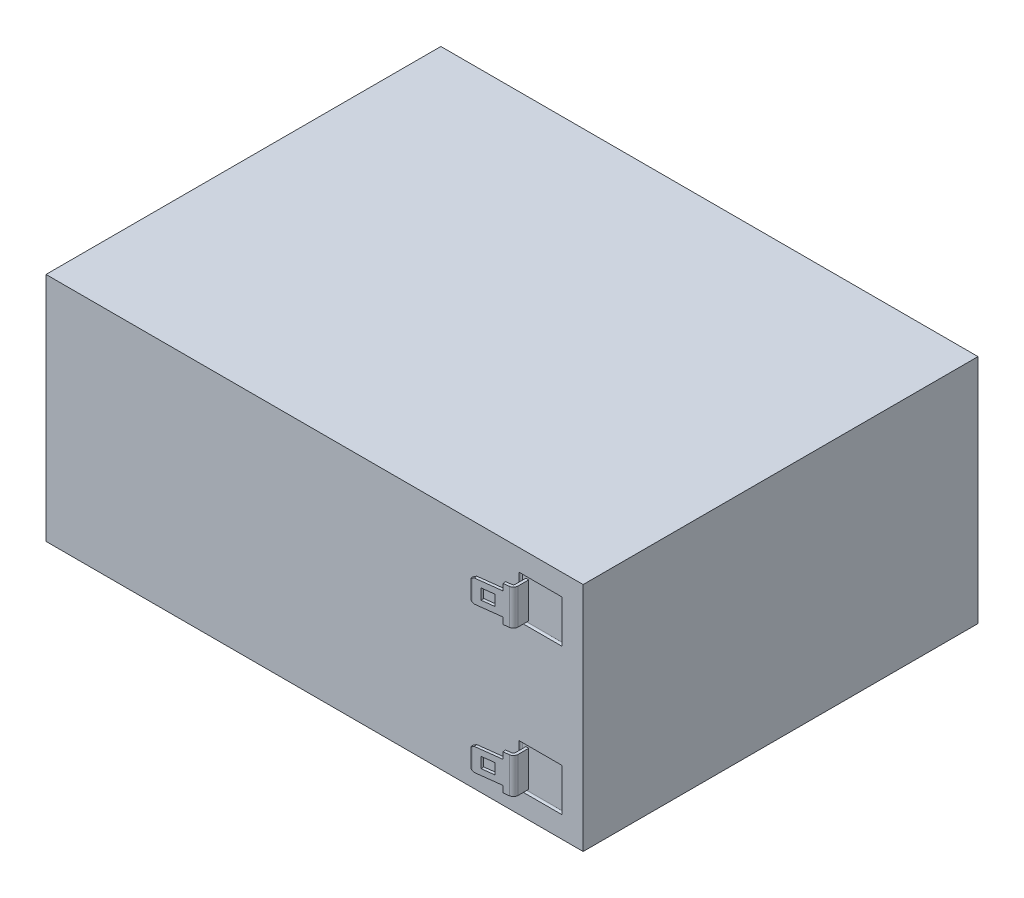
ISO-10303-21;
HEADER;
FILE_DESCRIPTION(('STEP AP214'),'2;1');
FILE_NAME('part.step','',(''),(''),'','','');
FILE_SCHEMA(('AUTOMOTIVE_DESIGN { 1 0 10303 214 1 1 1 1 }'));
ENDSEC;
DATA;
#1=APPLICATION_CONTEXT('core data for automotive mechanical design processes');
#2=APPLICATION_PROTOCOL_DEFINITION('international standard','automotive_design',2000,#1);
#3=PRODUCT_CONTEXT('',#1,'mechanical');
#4=PRODUCT('Part','Part','',(#3));
#5=PRODUCT_RELATED_PRODUCT_CATEGORY('part','',(#4));
#6=PRODUCT_DEFINITION_FORMATION('','',#4);
#7=PRODUCT_DEFINITION_CONTEXT('part definition',#1,'design');
#8=PRODUCT_DEFINITION('design','',#6,#7);
#9=PRODUCT_DEFINITION_SHAPE('','',#8);
#10=(LENGTH_UNIT() NAMED_UNIT(*) SI_UNIT(.MILLI.,.METRE.));
#11=(NAMED_UNIT(*) PLANE_ANGLE_UNIT() SI_UNIT($,.RADIAN.));
#12=(NAMED_UNIT(*) SI_UNIT($,.STERADIAN.) SOLID_ANGLE_UNIT());
#13=UNCERTAINTY_MEASURE_WITH_UNIT(LENGTH_MEASURE(1.E-05),#10,'distance_accuracy_value','');
#14=(GEOMETRIC_REPRESENTATION_CONTEXT(3) GLOBAL_UNCERTAINTY_ASSIGNED_CONTEXT((#13)) GLOBAL_UNIT_ASSIGNED_CONTEXT((#10,
#11,#12)) REPRESENTATION_CONTEXT('',''));
#15=CARTESIAN_POINT('',(0.,0.,0.));
#16=DIRECTION('',(0.,0.,1.));
#17=DIRECTION('',(1.,0.,0.));
#18=AXIS2_PLACEMENT_3D('',#15,#16,#17);
#19=CARTESIAN_POINT('',(-26.4279300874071,-48.,115.158158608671));
#20=DIRECTION('',(-0.122814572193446,0.,-0.992429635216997));
#21=DIRECTION('',(-0.992429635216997,0.,0.122814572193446));
#22=AXIS2_PLACEMENT_3D('',#19,#20,#21);
#23=PLANE('',#22);
#24=DIRECTION('',(0.,-1.,0.));
#25=VECTOR('',#24,1.);
#26=CARTESIAN_POINT('',(-26.4279300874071,-48.,115.158158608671));
#27=LINE('',#26,#25);
#28=CARTESIAN_POINT('',(-26.4279300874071,-50.1771836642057,115.158158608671));
#29=VERTEX_POINT('',#28);
#30=CARTESIAN_POINT('',(-26.4279300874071,-55.8228163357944,115.158158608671));
#31=VERTEX_POINT('',#30);
#32=EDGE_CURVE('E507',#29,#31,#27,.T.);
#33=ORIENTED_EDGE('',*,*,#32,.F.);
#34=DIRECTION('',(-0.859469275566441,-0.500000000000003,0.106360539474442));
#35=VECTOR('',#34,1.);
#36=CARTESIAN_POINT('',(-26.8149776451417,-50.4023502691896,115.206056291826));
#37=LINE('',#36,#35);
#38=CARTESIAN_POINT('',(-25.8225480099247,-49.825,115.083241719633));
#39=VERTEX_POINT('',#38);
#40=EDGE_CURVE('E417',#39,#29,#37,.T.);
#41=ORIENTED_EDGE('',*,*,#40,.F.);
#42=DIRECTION('',(-0.992429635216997,0.,0.122814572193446));
#43=VECTOR('',#42,1.);
#44=CARTESIAN_POINT('',(-25.8225480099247,-49.825,115.083241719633));
#45=LINE('',#44,#43);
#46=CARTESIAN_POINT('',(-18.6274331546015,-49.825,114.192836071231));
#47=VERTEX_POINT('',#46);
#48=EDGE_CURVE('E400',#47,#39,#45,.T.);
#49=ORIENTED_EDGE('',*,*,#48,.F.);
#50=DIRECTION('',(0.,-1.,0.));
#51=VECTOR('',#50,1.);
#52=CARTESIAN_POINT('',(-18.6274331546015,-49.825,114.192836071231));
#53=LINE('',#52,#51);
#54=CARTESIAN_POINT('',(-18.6274331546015,-48.,114.19283607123));
#55=VERTEX_POINT('',#54);
#56=EDGE_CURVE('E402',#55,#47,#53,.T.);
#57=ORIENTED_EDGE('',*,*,#56,.F.);
#58=DIRECTION('',(0.992429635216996,0.,-0.122814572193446));
#59=VECTOR('',#58,1.);
#60=CARTESIAN_POINT('',(-26.4279300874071,-48.,115.158158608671));
#61=LINE('',#60,#59);
#62=CARTESIAN_POINT('',(-17.0385927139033,-48.,113.996214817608));
#63=VERTEX_POINT('',#62);
#64=EDGE_CURVE('E466',#55,#63,#61,.T.);
#65=ORIENTED_EDGE('',*,*,#64,.T.);
#66=DIRECTION('',(0.,-1.,0.));
#67=VECTOR('',#66,1.);
#68=CARTESIAN_POINT('',(-17.0385927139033,-48.,113.996214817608));
#69=LINE('',#68,#67);
#70=CARTESIAN_POINT('',(-17.0385927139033,-58.,113.996214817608));
#71=VERTEX_POINT('',#70);
#72=EDGE_CURVE('E509',#63,#71,#69,.T.);
#73=ORIENTED_EDGE('',*,*,#72,.T.);
#74=DIRECTION('',(0.992429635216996,0.,-0.122814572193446));
#75=VECTOR('',#74,1.);
#76=CARTESIAN_POINT('',(-26.4279300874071,-58.,115.158158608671));
#77=LINE('',#76,#75);
#78=CARTESIAN_POINT('',(-18.6274331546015,-58.,114.192836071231));
#79=VERTEX_POINT('',#78);
#80=EDGE_CURVE('E486',#79,#71,#77,.T.);
#81=ORIENTED_EDGE('',*,*,#80,.F.);
#82=DIRECTION('',(0.,-1.,0.));
#83=VECTOR('',#82,1.);
#84=CARTESIAN_POINT('',(-18.6274331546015,-56.175,114.192836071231));
#85=LINE('',#84,#83);
#86=CARTESIAN_POINT('',(-18.6274331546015,-56.175,114.192836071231));
#87=VERTEX_POINT('',#86);
#88=EDGE_CURVE('E430',#87,#79,#85,.T.);
#89=ORIENTED_EDGE('',*,*,#88,.F.);
#90=DIRECTION('',(0.992429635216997,0.,-0.122814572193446));
#91=VECTOR('',#90,1.);
#92=CARTESIAN_POINT('',(-25.8225480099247,-56.175,115.083241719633));
#93=LINE('',#92,#91);
#94=CARTESIAN_POINT('',(-25.8225480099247,-56.175,115.083241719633));
#95=VERTEX_POINT('',#94);
#96=EDGE_CURVE('E432',#95,#87,#93,.T.);
#97=ORIENTED_EDGE('',*,*,#96,.F.);
#98=DIRECTION('',(0.859469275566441,-0.500000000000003,-0.106360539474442));
#99=VECTOR('',#98,1.);
#100=CARTESIAN_POINT('',(-26.8149776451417,-55.5976497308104,115.206056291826));
#101=LINE('',#100,#99);
#102=EDGE_CURVE('E435',#31,#95,#101,.T.);
#103=ORIENTED_EDGE('',*,*,#102,.F.);
#104=EDGE_LOOP('',(#33,#41,#49,#57,#65,#73,#81,#89,#97,#103));
#105=FACE_BOUND('',#104,.T.);
#106=DIRECTION('',(0.,1.,0.));
#107=VECTOR('',#106,1.);
#108=CARTESIAN_POINT('',(-24.085796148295,-54.5,114.868316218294));
#109=LINE('',#108,#107);
#110=CARTESIAN_POINT('',(-24.085796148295,-54.5,114.868316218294));
#111=VERTEX_POINT('',#110);
#112=CARTESIAN_POINT('',(-24.085796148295,-51.5,114.868316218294));
#113=VERTEX_POINT('',#112);
#114=EDGE_CURVE('E381',#111,#113,#109,.T.);
#115=ORIENTED_EDGE('',*,*,#114,.F.);
#116=DIRECTION('',(-0.992429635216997,0.,0.122814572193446));
#117=VECTOR('',#116,1.);
#118=CARTESIAN_POINT('',(-24.085796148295,-54.5,114.868316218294));
#119=LINE('',#118,#117);
#120=CARTESIAN_POINT('',(-20.6122924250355,-54.5,114.438465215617));
#121=VERTEX_POINT('',#120);
#122=EDGE_CURVE('E53',#121,#111,#119,.T.);
#123=ORIENTED_EDGE('',*,*,#122,.F.);
#124=DIRECTION('',(0.,-1.,0.));
#125=VECTOR('',#124,1.);
#126=CARTESIAN_POINT('',(-20.6122924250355,-54.5,114.438465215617));
#127=LINE('',#126,#125);
#128=CARTESIAN_POINT('',(-20.6122924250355,-51.5,114.438465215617));
#129=VERTEX_POINT('',#128);
#130=EDGE_CURVE('E1367',#129,#121,#127,.T.);
#131=ORIENTED_EDGE('',*,*,#130,.F.);
#132=DIRECTION('',(0.992429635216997,0.,-0.122814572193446));
#133=VECTOR('',#132,1.);
#134=CARTESIAN_POINT('',(-24.085796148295,-51.5,114.868316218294));
#135=LINE('',#134,#133);
#136=EDGE_CURVE('E1365',#113,#129,#135,.T.);
#137=ORIENTED_EDGE('',*,*,#136,.F.);
#138=EDGE_LOOP('',(#115,#123,#131,#137));
#139=FACE_BOUND('',#138,.T.);
#140=ADVANCED_FACE('F36',(#105,#139),#23,.T.);
#141=CARTESIAN_POINT('',(-16.9403410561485,-48.,114.790158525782));
#142=DIRECTION('',(0.122814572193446,0.,0.992429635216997));
#143=DIRECTION('',(0.992429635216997,0.,-0.122814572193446));
#144=AXIS2_PLACEMENT_3D('',#141,#142,#143);
#145=PLANE('',#144);
#146=DIRECTION('',(-0.992429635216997,0.,0.122814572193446));
#147=VECTOR('',#146,1.);
#148=CARTESIAN_POINT('',(-25.72429635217,-49.825,115.877185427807));
#149=LINE('',#148,#147);
#150=CARTESIAN_POINT('',(-18.5291814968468,-49.825,114.986779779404));
#151=VERTEX_POINT('',#150);
#152=CARTESIAN_POINT('',(-25.72429635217,-49.825,115.877185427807));
#153=VERTEX_POINT('',#152);
#154=EDGE_CURVE('E407',#151,#153,#149,.T.);
#155=ORIENTED_EDGE('',*,*,#154,.T.);
#156=DIRECTION('',(-0.859469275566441,-0.500000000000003,0.106360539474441));
#157=VECTOR('',#156,1.);
#158=CARTESIAN_POINT('',(-26.716725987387,-50.4023502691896,116.));
#159=LINE('',#158,#157);
#160=CARTESIAN_POINT('',(-26.3296784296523,-50.1771836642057,115.952102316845));
#161=VERTEX_POINT('',#160);
#162=EDGE_CURVE('E404',#153,#161,#159,.T.);
#163=ORIENTED_EDGE('',*,*,#162,.T.);
#164=DIRECTION('',(0.,-1.,0.));
#165=VECTOR('',#164,1.);
#166=CARTESIAN_POINT('',(-26.3296784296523,-48.,115.952102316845));
#167=LINE('',#166,#165);
#168=CARTESIAN_POINT('',(-26.3296784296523,-55.8228163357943,115.952102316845));
#169=VERTEX_POINT('',#168);
#170=EDGE_CURVE('E501',#161,#169,#167,.T.);
#171=ORIENTED_EDGE('',*,*,#170,.T.);
#172=DIRECTION('',(0.859469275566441,-0.500000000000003,-0.106360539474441));
#173=VECTOR('',#172,1.);
#174=CARTESIAN_POINT('',(-26.716725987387,-55.5976497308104,116.));
#175=LINE('',#174,#173);
#176=CARTESIAN_POINT('',(-25.72429635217,-56.175,115.877185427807));
#177=VERTEX_POINT('',#176);
#178=EDGE_CURVE('E444',#169,#177,#175,.T.);
#179=ORIENTED_EDGE('',*,*,#178,.T.);
#180=DIRECTION('',(0.992429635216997,0.,-0.122814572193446));
#181=VECTOR('',#180,1.);
#182=CARTESIAN_POINT('',(-25.72429635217,-56.175,115.877185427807));
#183=LINE('',#182,#181);
#184=CARTESIAN_POINT('',(-18.5291814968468,-56.175,114.986779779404));
#185=VERTEX_POINT('',#184);
#186=EDGE_CURVE('E441',#177,#185,#183,.T.);
#187=ORIENTED_EDGE('',*,*,#186,.T.);
#188=DIRECTION('',(0.,-1.,0.));
#189=VECTOR('',#188,1.);
#190=CARTESIAN_POINT('',(-18.5291814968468,-56.175,114.986779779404));
#191=LINE('',#190,#189);
#192=CARTESIAN_POINT('',(-18.5291814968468,-58.,114.986779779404));
#193=VERTEX_POINT('',#192);
#194=EDGE_CURVE('E438',#185,#193,#191,.T.);
#195=ORIENTED_EDGE('',*,*,#194,.T.);
#196=DIRECTION('',(-0.992429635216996,0.,0.122814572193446));
#197=VECTOR('',#196,1.);
#198=CARTESIAN_POINT('',(-16.9403410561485,-58.,114.790158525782));
#199=LINE('',#198,#197);
#200=CARTESIAN_POINT('',(-16.9403410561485,-58.,114.790158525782));
#201=VERTEX_POINT('',#200);
#202=EDGE_CURVE('E488',#201,#193,#199,.T.);
#203=ORIENTED_EDGE('',*,*,#202,.F.);
#204=DIRECTION('',(0.,-1.,0.));
#205=VECTOR('',#204,1.);
#206=CARTESIAN_POINT('',(-16.9403410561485,-48.,114.790158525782));
#207=LINE('',#206,#205);
#208=CARTESIAN_POINT('',(-16.9403410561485,-48.,114.790158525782));
#209=VERTEX_POINT('',#208);
#210=EDGE_CURVE('E499',#209,#201,#207,.T.);
#211=ORIENTED_EDGE('',*,*,#210,.F.);
#212=DIRECTION('',(-0.992429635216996,0.,0.122814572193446));
#213=VECTOR('',#212,1.);
#214=CARTESIAN_POINT('',(-16.9403410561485,-48.,114.790158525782));
#215=LINE('',#214,#213);
#216=CARTESIAN_POINT('',(-18.5291814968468,-48.,114.986779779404));
#217=VERTEX_POINT('',#216);
#218=EDGE_CURVE('E468',#209,#217,#215,.T.);
#219=ORIENTED_EDGE('',*,*,#218,.T.);
#220=DIRECTION('',(0.,-1.,0.));
#221=VECTOR('',#220,1.);
#222=CARTESIAN_POINT('',(-18.5291814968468,-49.825,114.986779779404));
#223=LINE('',#222,#221);
#224=EDGE_CURVE('E410',#217,#151,#223,.T.);
#225=ORIENTED_EDGE('',*,*,#224,.T.);
#226=EDGE_LOOP('',(#155,#163,#171,#179,#187,#195,#203,#211,#219,#225));
#227=FACE_BOUND('',#226,.T.);
#228=DIRECTION('',(0.,-1.,0.));
#229=VECTOR('',#228,1.);
#230=CARTESIAN_POINT('',(-20.5140407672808,-54.5,115.232408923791));
#231=LINE('',#230,#229);
#232=CARTESIAN_POINT('',(-20.5140407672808,-51.5,115.232408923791));
#233=VERTEX_POINT('',#232);
#234=CARTESIAN_POINT('',(-20.5140407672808,-54.5,115.232408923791));
#235=VERTEX_POINT('',#234);
#236=EDGE_CURVE('E385',#233,#235,#231,.T.);
#237=ORIENTED_EDGE('',*,*,#236,.T.);
#238=DIRECTION('',(-0.992429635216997,0.,0.122814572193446));
#239=VECTOR('',#238,1.);
#240=CARTESIAN_POINT('',(-23.9875444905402,-54.5,115.662259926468));
#241=LINE('',#240,#239);
#242=CARTESIAN_POINT('',(-23.9875444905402,-54.5,115.662259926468));
#243=VERTEX_POINT('',#242);
#244=EDGE_CURVE('E369',#235,#243,#241,.T.);
#245=ORIENTED_EDGE('',*,*,#244,.T.);
#246=DIRECTION('',(0.,1.,0.));
#247=VECTOR('',#246,1.);
#248=CARTESIAN_POINT('',(-23.9875444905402,-54.5,115.662259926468));
#249=LINE('',#248,#247);
#250=CARTESIAN_POINT('',(-23.9875444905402,-51.5,115.662259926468));
#251=VERTEX_POINT('',#250);
#252=EDGE_CURVE('E377',#243,#251,#249,.T.);
#253=ORIENTED_EDGE('',*,*,#252,.T.);
#254=DIRECTION('',(0.992429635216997,0.,-0.122814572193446));
#255=VECTOR('',#254,1.);
#256=CARTESIAN_POINT('',(-23.9875444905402,-51.5,115.662259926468));
#257=LINE('',#256,#255);
#258=EDGE_CURVE('E61',#251,#233,#257,.T.);
#259=ORIENTED_EDGE('',*,*,#258,.T.);
#260=EDGE_LOOP('',(#237,#245,#253,#259));
#261=FACE_BOUND('',#260,.T.);
#262=ADVANCED_FACE('F383',(#227,#261),#145,.T.);
#263=CARTESIAN_POINT('',(-26.3800324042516,-48.,115.545206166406));
#264=DIRECTION('',(0.,-1.,0.));
#265=DIRECTION('',(1.,0.,0.));
#266=AXIS2_PLACEMENT_3D('',#263,#264,#265);
#267=CYLINDRICAL_SURFACE('',#266,0.389999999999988);
#268=DIRECTION('',(0.,-1.,0.));
#269=VECTOR('',#268,1.);
#270=CARTESIAN_POINT('',(-26.7670799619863,-48.,115.593103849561));
#271=LINE('',#270,#269);
#272=CARTESIAN_POINT('',(-26.7670799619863,-50.4023502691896,115.593103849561));
#273=VERTEX_POINT('',#272);
#274=CARTESIAN_POINT('',(-26.7670799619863,-55.5976497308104,115.593103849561));
#275=VERTEX_POINT('',#274);
#276=EDGE_CURVE('E505',#273,#275,#271,.T.);
#277=ORIENTED_EDGE('',*,*,#276,.F.);
#278=CARTESIAN_POINT('',(-26.3800324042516,-50.1771836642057,115.545206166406));
#279=DIRECTION('',(-0.496214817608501,0.866025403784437,0.0614072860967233));
#280=DIRECTION('',(-0.859469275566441,-0.500000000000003,0.106360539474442));
#281=AXIS2_PLACEMENT_3D('',#278,#279,#280);
#282=ELLIPSE('',#281,0.450333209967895,0.389999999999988);
#283=EDGE_CURVE('E398',#29,#273,#282,.T.);
#284=ORIENTED_EDGE('',*,*,#283,.F.);
#285=ORIENTED_EDGE('',*,*,#32,.T.);
#286=CARTESIAN_POINT('',(-26.3800324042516,-55.8228163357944,115.545206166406));
#287=DIRECTION('',(-0.496214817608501,-0.866025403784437,0.0614072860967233));
#288=DIRECTION('',(0.859469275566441,-0.500000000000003,-0.106360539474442));
#289=AXIS2_PLACEMENT_3D('',#286,#287,#288);
#290=ELLIPSE('',#289,0.450333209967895,0.389999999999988);
#291=EDGE_CURVE('E427',#275,#31,#290,.T.);
#292=ORIENTED_EDGE('',*,*,#291,.F.);
#293=EDGE_LOOP('',(#277,#284,#285,#292));
#294=FACE_BOUND('',#293,.T.);
#295=ADVANCED_FACE('F796',(#294),#267,.T.);
#296=CARTESIAN_POINT('',(-26.7646236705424,-48.,115.612952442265));
#297=DIRECTION('',(-0.992429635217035,0.,0.122814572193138));
#298=DIRECTION('',(0.122814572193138,0.,0.992429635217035));
#299=AXIS2_PLACEMENT_3D('',#296,#297,#298);
#300=PLANE('',#299);
#301=DIRECTION('',(0.,-1.,0.));
#302=VECTOR('',#301,1.);
#303=CARTESIAN_POINT('',(-26.7646236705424,-48.,115.612952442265));
#304=LINE('',#303,#302);
#305=CARTESIAN_POINT('',(-26.7646236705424,-50.4023502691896,115.612952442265));
#306=VERTEX_POINT('',#305);
#307=CARTESIAN_POINT('',(-26.7646236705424,-55.5976497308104,115.612952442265));
#308=VERTEX_POINT('',#307);
#309=EDGE_CURVE('E503',#306,#308,#304,.T.);
#310=ORIENTED_EDGE('',*,*,#309,.F.);
#311=DIRECTION('',(0.122814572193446,0.,0.992429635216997));
#312=VECTOR('',#311,1.);
#313=CARTESIAN_POINT('',(-42.7301189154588,-50.4023502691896,-13.3996747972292));
#314=LINE('',#313,#312);
#315=EDGE_CURVE('E413',#273,#306,#314,.T.);
#316=ORIENTED_EDGE('',*,*,#315,.F.);
#317=ORIENTED_EDGE('',*,*,#276,.T.);
#318=DIRECTION('',(0.122814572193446,0.,0.992429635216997));
#319=VECTOR('',#318,1.);
#320=CARTESIAN_POINT('',(-42.7301189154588,-55.5976497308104,-13.3996747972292));
#321=LINE('',#320,#319);
#322=EDGE_CURVE('E448',#275,#308,#321,.T.);
#323=ORIENTED_EDGE('',*,*,#322,.T.);
#324=EDGE_LOOP('',(#310,#316,#317,#323));
#325=FACE_BOUND('',#324,.T.);
#326=ADVANCED_FACE('F1235',(#325),#300,.T.);
#327=CARTESIAN_POINT('',(-26.3775761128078,-48.,115.56505475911));
#328=DIRECTION('',(0.,-1.,0.));
#329=DIRECTION('',(1.,0.,0.));
#330=AXIS2_PLACEMENT_3D('',#327,#328,#329);
#331=CYLINDRICAL_SURFACE('',#330,0.390000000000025);
#332=ORIENTED_EDGE('',*,*,#170,.F.);
#333=CARTESIAN_POINT('',(-26.3775761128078,-50.1771836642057,115.56505475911));
#334=DIRECTION('',(-0.496214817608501,0.866025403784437,0.0614072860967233));
#335=DIRECTION('',(-0.859469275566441,-0.500000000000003,0.106360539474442));
#336=AXIS2_PLACEMENT_3D('',#333,#334,#335);
#337=ELLIPSE('',#336,0.450333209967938,0.390000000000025);
#338=EDGE_CURVE('E396',#306,#161,#337,.T.);
#339=ORIENTED_EDGE('',*,*,#338,.F.);
#340=ORIENTED_EDGE('',*,*,#309,.T.);
#341=CARTESIAN_POINT('',(-26.3775761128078,-55.8228163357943,115.56505475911));
#342=DIRECTION('',(-0.496214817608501,-0.866025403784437,0.0614072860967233));
#343=DIRECTION('',(0.859469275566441,-0.500000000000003,-0.106360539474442));
#344=AXIS2_PLACEMENT_3D('',#341,#342,#343);
#345=ELLIPSE('',#344,0.450333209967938,0.390000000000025);
#346=EDGE_CURVE('E424',#169,#308,#345,.T.);
#347=ORIENTED_EDGE('',*,*,#346,.F.);
#348=EDGE_LOOP('',(#332,#339,#340,#347));
#349=FACE_BOUND('',#348,.T.);
#350=ADVANCED_FACE('F1226',(#349),#331,.T.);
#351=CARTESIAN_POINT('',(-17.1,-48.,113.5));
#352=DIRECTION('',(0.,1.,0.));
#353=DIRECTION('',(1.,0.,0.));
#354=AXIS2_PLACEMENT_3D('',#351,#352,#353);
#355=PLANE('',#354);
#356=ORIENTED_EDGE('',*,*,#64,.F.);
#357=DIRECTION('',(0.122814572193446,0.,0.992429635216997));
#358=VECTOR('',#357,1.);
#359=CARTESIAN_POINT('',(-34.5425744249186,-48.,-14.4128950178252));
#360=LINE('',#359,#358);
#361=EDGE_CURVE('E414',#55,#217,#360,.T.);
#362=ORIENTED_EDGE('',*,*,#361,.T.);
#363=ORIENTED_EDGE('',*,*,#218,.F.);
#364=CARTESIAN_POINT('',(-17.1,-48.,113.5));
#365=DIRECTION('',(0.,-1.,0.));
#366=DIRECTION('',(1.,0.,0.));
#367=AXIS2_PLACEMENT_3D('',#364,#365,#366);
#368=CIRCLE('',#367,1.30000000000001);
#369=CARTESIAN_POINT('',(-15.8,-48.,113.5));
#370=VERTEX_POINT('',#369);
#371=EDGE_CURVE('E471',#370,#209,#368,.T.);
#372=ORIENTED_EDGE('',*,*,#371,.F.);
#373=DIRECTION('',(0.,0.,1.));
#374=VECTOR('',#373,1.);
#375=CARTESIAN_POINT('',(-15.8,-48.,110.5));
#376=LINE('',#375,#374);
#377=CARTESIAN_POINT('',(-15.8,-48.,110.5));
#378=VERTEX_POINT('',#377);
#379=EDGE_CURVE('E474',#378,#370,#376,.T.);
#380=ORIENTED_EDGE('',*,*,#379,.F.);
#381=DIRECTION('',(1.,0.,0.));
#382=VECTOR('',#381,1.);
#383=CARTESIAN_POINT('',(-16.6,-48.,110.5));
#384=LINE('',#383,#382);
#385=CARTESIAN_POINT('',(-16.6,-48.,110.5));
#386=VERTEX_POINT('',#385);
#387=EDGE_CURVE('E457',#386,#378,#384,.T.);
#388=ORIENTED_EDGE('',*,*,#387,.F.);
#389=DIRECTION('',(0.,0.,-1.));
#390=VECTOR('',#389,1.);
#391=CARTESIAN_POINT('',(-16.6,-48.,113.5));
#392=LINE('',#391,#390);
#393=CARTESIAN_POINT('',(-16.6,-48.,113.5));
#394=VERTEX_POINT('',#393);
#395=EDGE_CURVE('E459',#394,#386,#392,.T.);
#396=ORIENTED_EDGE('',*,*,#395,.F.);
#397=CARTESIAN_POINT('',(-17.1,-48.,113.5));
#398=DIRECTION('',(0.,1.,0.));
#399=DIRECTION('',(-1.,0.,0.));
#400=AXIS2_PLACEMENT_3D('',#397,#398,#399);
#401=CIRCLE('',#400,0.499999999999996);
#402=EDGE_CURVE('E463',#63,#394,#401,.T.);
#403=ORIENTED_EDGE('',*,*,#402,.F.);
#404=EDGE_LOOP('',(#356,#362,#363,#372,#380,#388,#396,#403));
#405=FACE_BOUND('',#404,.T.);
#406=ADVANCED_FACE('F784',(#405),#355,.T.);
#407=CARTESIAN_POINT('',(-17.1,-58.,113.5));
#408=DIRECTION('',(0.,1.,0.));
#409=DIRECTION('',(1.,0.,0.));
#410=AXIS2_PLACEMENT_3D('',#407,#408,#409);
#411=PLANE('',#410);
#412=DIRECTION('',(0.122814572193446,0.,0.992429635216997));
#413=VECTOR('',#412,1.);
#414=CARTESIAN_POINT('',(-34.5425744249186,-58.,-14.4128950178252));
#415=LINE('',#414,#413);
#416=EDGE_CURVE('E447',#79,#193,#415,.T.);
#417=ORIENTED_EDGE('',*,*,#416,.F.);
#418=ORIENTED_EDGE('',*,*,#80,.T.);
#419=CARTESIAN_POINT('',(-17.1,-58.,113.5));
#420=DIRECTION('',(0.,1.,0.));
#421=DIRECTION('',(-1.,0.,0.));
#422=AXIS2_PLACEMENT_3D('',#419,#420,#421);
#423=CIRCLE('',#422,0.499999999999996);
#424=CARTESIAN_POINT('',(-16.6,-58.,113.5));
#425=VERTEX_POINT('',#424);
#426=EDGE_CURVE('E483',#71,#425,#423,.T.);
#427=ORIENTED_EDGE('',*,*,#426,.T.);
#428=DIRECTION('',(0.,0.,-1.));
#429=VECTOR('',#428,1.);
#430=CARTESIAN_POINT('',(-16.6,-58.,113.5));
#431=LINE('',#430,#429);
#432=CARTESIAN_POINT('',(-16.6,-58.,110.5));
#433=VERTEX_POINT('',#432);
#434=EDGE_CURVE('E480',#425,#433,#431,.T.);
#435=ORIENTED_EDGE('',*,*,#434,.T.);
#436=DIRECTION('',(1.,0.,0.));
#437=VECTOR('',#436,1.);
#438=CARTESIAN_POINT('',(-16.6,-58.,110.5));
#439=LINE('',#438,#437);
#440=CARTESIAN_POINT('',(-15.8,-58.,110.5));
#441=VERTEX_POINT('',#440);
#442=EDGE_CURVE('E451',#433,#441,#439,.T.);
#443=ORIENTED_EDGE('',*,*,#442,.T.);
#444=DIRECTION('',(0.,0.,1.));
#445=VECTOR('',#444,1.);
#446=CARTESIAN_POINT('',(-15.8,-58.,110.5));
#447=LINE('',#446,#445);
#448=CARTESIAN_POINT('',(-15.8,-58.,113.5));
#449=VERTEX_POINT('',#448);
#450=EDGE_CURVE('E460',#441,#449,#447,.T.);
#451=ORIENTED_EDGE('',*,*,#450,.T.);
#452=CARTESIAN_POINT('',(-17.1,-58.,113.5));
#453=DIRECTION('',(0.,-1.,0.));
#454=DIRECTION('',(1.,0.,0.));
#455=AXIS2_PLACEMENT_3D('',#452,#453,#454);
#456=CIRCLE('',#455,1.30000000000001);
#457=EDGE_CURVE('E491',#449,#201,#456,.T.);
#458=ORIENTED_EDGE('',*,*,#457,.T.);
#459=ORIENTED_EDGE('',*,*,#202,.T.);
#460=EDGE_LOOP('',(#417,#418,#427,#435,#443,#451,#458,#459));
#461=FACE_BOUND('',#460,.T.);
#462=ADVANCED_FACE('F774',(#461),#411,.F.);
#463=CARTESIAN_POINT('',(-151.,0.,111.));
#464=DIRECTION('',(0.,0.,1.));
#465=DIRECTION('',(1.,0.,0.));
#466=AXIS2_PLACEMENT_3D('',#463,#464,#465);
#467=PLANE('',#466);
#468=DIRECTION('',(0.,-1.,0.));
#469=VECTOR('',#468,1.);
#470=CARTESIAN_POINT('',(-151.,0.,111.));
#471=LINE('',#470,#469);
#472=CARTESIAN_POINT('',(-151.,0.,111.));
#473=VERTEX_POINT('',#472);
#474=CARTESIAN_POINT('',(-151.,-65.,111.));
#475=VERTEX_POINT('',#474);
#476=EDGE_CURVE('E693',#473,#475,#471,.T.);
#477=ORIENTED_EDGE('',*,*,#476,.T.);
#478=DIRECTION('',(1.,0.,0.));
#479=VECTOR('',#478,1.);
#480=CARTESIAN_POINT('',(-151.,-65.,111.));
#481=LINE('',#480,#479);
#482=CARTESIAN_POINT('',(0.,-65.,111.));
#483=VERTEX_POINT('',#482);
#484=EDGE_CURVE('E696',#475,#483,#481,.T.);
#485=ORIENTED_EDGE('',*,*,#484,.T.);
#486=DIRECTION('',(0.,1.,0.));
#487=VECTOR('',#486,1.);
#488=CARTESIAN_POINT('',(0.,0.,111.));
#489=LINE('',#488,#487);
#490=CARTESIAN_POINT('',(0.,0.,111.));
#491=VERTEX_POINT('',#490);
#492=EDGE_CURVE('E699',#483,#491,#489,.T.);
#493=ORIENTED_EDGE('',*,*,#492,.T.);
#494=DIRECTION('',(-1.,0.,0.));
#495=VECTOR('',#494,1.);
#496=CARTESIAN_POINT('',(-151.,0.,111.));
#497=LINE('',#496,#495);
#498=EDGE_CURVE('E701',#491,#473,#497,.T.);
#499=ORIENTED_EDGE('',*,*,#498,.T.);
#500=EDGE_LOOP('',(#477,#485,#493,#499));
#501=FACE_BOUND('',#500,.T.);
#502=DIRECTION('',(0.,1.,0.));
#503=VECTOR('',#502,1.);
#504=CARTESIAN_POINT('',(-6.,-6.,111.));
#505=LINE('',#504,#503);
#506=CARTESIAN_POINT('',(-5.99999999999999,-18.,111.));
#507=VERTEX_POINT('',#506);
#508=CARTESIAN_POINT('',(-6.00000000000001,-6.,111.));
#509=VERTEX_POINT('',#508);
#510=EDGE_CURVE('E679',#507,#509,#505,.T.);
#511=ORIENTED_EDGE('',*,*,#510,.F.);
#512=DIRECTION('',(1.,0.,0.));
#513=VECTOR('',#512,1.);
#514=CARTESIAN_POINT('',(-5.99999999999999,-18.,111.));
#515=LINE('',#514,#513);
#516=CARTESIAN_POINT('',(-18.,-18.,111.));
#517=VERTEX_POINT('',#516);
#518=EDGE_CURVE('E689',#517,#507,#515,.T.);
#519=ORIENTED_EDGE('',*,*,#518,.F.);
#520=DIRECTION('',(0.,-1.,0.));
#521=VECTOR('',#520,1.);
#522=CARTESIAN_POINT('',(-18.,-6.,111.));
#523=LINE('',#522,#521);
#524=CARTESIAN_POINT('',(-18.,-6.,111.));
#525=VERTEX_POINT('',#524);
#526=EDGE_CURVE('E686',#525,#517,#523,.T.);
#527=ORIENTED_EDGE('',*,*,#526,.F.);
#528=DIRECTION('',(-1.,0.,0.));
#529=VECTOR('',#528,1.);
#530=CARTESIAN_POINT('',(-6.,-6.,111.));
#531=LINE('',#530,#529);
#532=EDGE_CURVE('E682',#509,#525,#531,.T.);
#533=ORIENTED_EDGE('',*,*,#532,.F.);
#534=EDGE_LOOP('',(#511,#519,#527,#533));
#535=FACE_BOUND('',#534,.T.);
#536=DIRECTION('',(1.,0.,0.));
#537=VECTOR('',#536,1.);
#538=CARTESIAN_POINT('',(-5.99999999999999,-47.,111.));
#539=LINE('',#538,#537);
#540=CARTESIAN_POINT('',(-18.,-47.,111.));
#541=VERTEX_POINT('',#540);
#542=CARTESIAN_POINT('',(-6.00000000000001,-47.,111.));
#543=VERTEX_POINT('',#542);
#544=EDGE_CURVE('E520',#541,#543,#539,.T.);
#545=ORIENTED_EDGE('',*,*,#544,.T.);
#546=DIRECTION('',(0.,-1.,0.));
#547=VECTOR('',#546,1.);
#548=CARTESIAN_POINT('',(-6.,-59.,111.));
#549=LINE('',#548,#547);
#550=CARTESIAN_POINT('',(-6.,-59.,111.));
#551=VERTEX_POINT('',#550);
#552=EDGE_CURVE('E518',#543,#551,#549,.T.);
#553=ORIENTED_EDGE('',*,*,#552,.T.);
#554=DIRECTION('',(-1.,0.,0.));
#555=VECTOR('',#554,1.);
#556=CARTESIAN_POINT('',(-6.,-59.,111.));
#557=LINE('',#556,#555);
#558=CARTESIAN_POINT('',(-18.,-59.,111.));
#559=VERTEX_POINT('',#558);
#560=EDGE_CURVE('E524',#551,#559,#557,.T.);
#561=ORIENTED_EDGE('',*,*,#560,.T.);
#562=DIRECTION('',(0.,1.,0.));
#563=VECTOR('',#562,1.);
#564=CARTESIAN_POINT('',(-18.,-59.,111.));
#565=LINE('',#564,#563);
#566=EDGE_CURVE('E522',#559,#541,#565,.T.);
#567=ORIENTED_EDGE('',*,*,#566,.T.);
#568=EDGE_LOOP('',(#545,#553,#561,#567));
#569=FACE_BOUND('',#568,.T.);
#570=ADVANCED_FACE('F771',(#501,#535,#569),#467,.T.);
#571=CARTESIAN_POINT('',(-151.,0.,111.));
#572=DIRECTION('',(1.,0.,0.));
#573=DIRECTION('',(0.,1.,0.));
#574=AXIS2_PLACEMENT_3D('',#571,#572,#573);
#575=PLANE('',#574);
#576=DIRECTION('',(0.,-1.,0.));
#577=VECTOR('',#576,1.);
#578=CARTESIAN_POINT('',(-151.,0.,0.));
#579=LINE('',#578,#577);
#580=CARTESIAN_POINT('',(-151.,0.,0.));
#581=VERTEX_POINT('',#580);
#582=CARTESIAN_POINT('',(-151.,-65.,0.));
#583=VERTEX_POINT('',#582);
#584=EDGE_CURVE('E692',#581,#583,#579,.T.);
#585=ORIENTED_EDGE('',*,*,#584,.T.);
#586=DIRECTION('',(0.,0.,-1.));
#587=VECTOR('',#586,1.);
#588=CARTESIAN_POINT('',(-151.,-65.,111.));
#589=LINE('',#588,#587);
#590=EDGE_CURVE('E719',#475,#583,#589,.T.);
#591=ORIENTED_EDGE('',*,*,#590,.F.);
#592=ORIENTED_EDGE('',*,*,#476,.F.);
#593=DIRECTION('',(0.,0.,-1.));
#594=VECTOR('',#593,1.);
#595=CARTESIAN_POINT('',(-151.,0.,111.));
#596=LINE('',#595,#594);
#597=EDGE_CURVE('E703',#473,#581,#596,.T.);
#598=ORIENTED_EDGE('',*,*,#597,.T.);
#599=EDGE_LOOP('',(#585,#591,#592,#598));
#600=FACE_BOUND('',#599,.T.);
#601=ADVANCED_FACE('F773',(#600),#575,.F.);
#602=CARTESIAN_POINT('',(-151.,-65.,111.));
#603=DIRECTION('',(0.,1.,0.));
#604=DIRECTION('',(-1.,0.,0.));
#605=AXIS2_PLACEMENT_3D('',#602,#603,#604);
#606=PLANE('',#605);
#607=DIRECTION('',(1.,0.,0.));
#608=VECTOR('',#607,1.);
#609=CARTESIAN_POINT('',(-151.,-65.,0.));
#610=LINE('',#609,#608);
#611=CARTESIAN_POINT('',(0.,-65.,0.));
#612=VERTEX_POINT('',#611);
#613=EDGE_CURVE('E706',#583,#612,#610,.T.);
#614=ORIENTED_EDGE('',*,*,#613,.T.);
#615=DIRECTION('',(0.,0.,-1.));
#616=VECTOR('',#615,1.);
#617=CARTESIAN_POINT('',(0.,-65.,111.));
#618=LINE('',#617,#616);
#619=EDGE_CURVE('E716',#483,#612,#618,.T.);
#620=ORIENTED_EDGE('',*,*,#619,.F.);
#621=ORIENTED_EDGE('',*,*,#484,.F.);
#622=ORIENTED_EDGE('',*,*,#590,.T.);
#623=EDGE_LOOP('',(#614,#620,#621,#622));
#624=FACE_BOUND('',#623,.T.);
#625=ADVANCED_FACE('F781',(#624),#606,.F.);
#626=CARTESIAN_POINT('',(0.,0.,111.));
#627=DIRECTION('',(-1.,0.,0.));
#628=DIRECTION('',(0.,-1.,0.));
#629=AXIS2_PLACEMENT_3D('',#626,#627,#628);
#630=PLANE('',#629);
#631=DIRECTION('',(0.,1.,0.));
#632=VECTOR('',#631,1.);
#633=CARTESIAN_POINT('',(0.,0.,0.));
#634=LINE('',#633,#632);
#635=CARTESIAN_POINT('',(0.,0.,0.));
#636=VERTEX_POINT('',#635);
#637=EDGE_CURVE('E708',#612,#636,#634,.T.);
#638=ORIENTED_EDGE('',*,*,#637,.T.);
#639=DIRECTION('',(0.,0.,-1.));
#640=VECTOR('',#639,1.);
#641=CARTESIAN_POINT('',(0.,0.,111.));
#642=LINE('',#641,#640);
#643=EDGE_CURVE('E713',#491,#636,#642,.T.);
#644=ORIENTED_EDGE('',*,*,#643,.F.);
#645=ORIENTED_EDGE('',*,*,#492,.F.);
#646=ORIENTED_EDGE('',*,*,#619,.T.);
#647=EDGE_LOOP('',(#638,#644,#645,#646));
#648=FACE_BOUND('',#647,.T.);
#649=ADVANCED_FACE('F1077',(#648),#630,.F.);
#650=CARTESIAN_POINT('',(-151.,0.,111.));
#651=DIRECTION('',(0.,-1.,0.));
#652=DIRECTION('',(1.,0.,0.));
#653=AXIS2_PLACEMENT_3D('',#650,#651,#652);
#654=PLANE('',#653);
#655=DIRECTION('',(-1.,0.,0.));
#656=VECTOR('',#655,1.);
#657=CARTESIAN_POINT('',(-151.,0.,0.));
#658=LINE('',#657,#656);
#659=EDGE_CURVE('E697',#636,#581,#658,.T.);
#660=ORIENTED_EDGE('',*,*,#659,.T.);
#661=ORIENTED_EDGE('',*,*,#597,.F.);
#662=ORIENTED_EDGE('',*,*,#498,.F.);
#663=ORIENTED_EDGE('',*,*,#643,.T.);
#664=EDGE_LOOP('',(#660,#661,#662,#663));
#665=FACE_BOUND('',#664,.T.);
#666=ADVANCED_FACE('F912',(#665),#654,.F.);
#667=CARTESIAN_POINT('',(-151.,0.,0.));
#668=DIRECTION('',(0.,0.,1.));
#669=DIRECTION('',(1.,0.,0.));
#670=AXIS2_PLACEMENT_3D('',#667,#668,#669);
#671=PLANE('',#670);
#672=ORIENTED_EDGE('',*,*,#584,.F.);
#673=ORIENTED_EDGE('',*,*,#659,.F.);
#674=ORIENTED_EDGE('',*,*,#637,.F.);
#675=ORIENTED_EDGE('',*,*,#613,.F.);
#676=EDGE_LOOP('',(#672,#673,#674,#675));
#677=FACE_BOUND('',#676,.T.);
#678=ADVANCED_FACE('F903',(#677),#671,.F.);
#679=CARTESIAN_POINT('',(-6.,-6.,110.5));
#680=DIRECTION('',(0.,0.,-1.));
#681=DIRECTION('',(-1.,0.,0.));
#682=AXIS2_PLACEMENT_3D('',#679,#680,#681);
#683=PLANE('',#682);
#684=DIRECTION('',(0.,1.,0.));
#685=VECTOR('',#684,1.);
#686=CARTESIAN_POINT('',(-15.8,-17.,110.5));
#687=LINE('',#686,#685);
#688=CARTESIAN_POINT('',(-15.8,-17.,110.5));
#689=VERTEX_POINT('',#688);
#690=CARTESIAN_POINT('',(-15.8,-7.,110.5));
#691=VERTEX_POINT('',#690);
#692=EDGE_CURVE('E675',#689,#691,#687,.T.);
#693=ORIENTED_EDGE('',*,*,#692,.F.);
#694=DIRECTION('',(1.,0.,0.));
#695=VECTOR('',#694,1.);
#696=CARTESIAN_POINT('',(-16.6,-17.,110.5));
#697=LINE('',#696,#695);
#698=CARTESIAN_POINT('',(-16.6,-17.,110.5));
#699=VERTEX_POINT('',#698);
#700=EDGE_CURVE('E621',#699,#689,#697,.T.);
#701=ORIENTED_EDGE('',*,*,#700,.F.);
#702=DIRECTION('',(0.,1.,0.));
#703=VECTOR('',#702,1.);
#704=CARTESIAN_POINT('',(-16.6,-17.,110.5));
#705=LINE('',#704,#703);
#706=CARTESIAN_POINT('',(-16.6,-7.,110.5));
#707=VERTEX_POINT('',#706);
#708=EDGE_CURVE('E639',#699,#707,#705,.T.);
#709=ORIENTED_EDGE('',*,*,#708,.T.);
#710=DIRECTION('',(1.,0.,0.));
#711=VECTOR('',#710,1.);
#712=CARTESIAN_POINT('',(-16.6,-7.,110.5));
#713=LINE('',#712,#711);
#714=EDGE_CURVE('E591',#707,#691,#713,.T.);
#715=ORIENTED_EDGE('',*,*,#714,.T.);
#716=EDGE_LOOP('',(#693,#701,#709,#715));
#717=FACE_BOUND('',#716,.T.);
#718=DIRECTION('',(0.,-1.,0.));
#719=VECTOR('',#718,1.);
#720=CARTESIAN_POINT('',(-17.5,-18.,110.5));
#721=LINE('',#720,#719);
#722=CARTESIAN_POINT('',(-17.5,-6.5,110.5));
#723=VERTEX_POINT('',#722);
#724=CARTESIAN_POINT('',(-17.5,-17.5,110.5));
#725=VERTEX_POINT('',#724);
#726=EDGE_CURVE('E726',#723,#725,#721,.T.);
#727=ORIENTED_EDGE('',*,*,#726,.T.);
#728=DIRECTION('',(1.,0.,0.));
#729=VECTOR('',#728,1.);
#730=CARTESIAN_POINT('',(-5.99999999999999,-17.5,110.5));
#731=LINE('',#730,#729);
#732=CARTESIAN_POINT('',(-6.49999999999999,-17.5,110.5));
#733=VERTEX_POINT('',#732);
#734=EDGE_CURVE('E728',#725,#733,#731,.T.);
#735=ORIENTED_EDGE('',*,*,#734,.T.);
#736=DIRECTION('',(0.,1.,0.));
#737=VECTOR('',#736,1.);
#738=CARTESIAN_POINT('',(-6.5,-6.,110.5));
#739=LINE('',#738,#737);
#740=CARTESIAN_POINT('',(-6.5,-6.5,110.5));
#741=VERTEX_POINT('',#740);
#742=EDGE_CURVE('E722',#733,#741,#739,.T.);
#743=ORIENTED_EDGE('',*,*,#742,.T.);
#744=DIRECTION('',(-1.,0.,0.));
#745=VECTOR('',#744,1.);
#746=CARTESIAN_POINT('',(-18.,-6.5,110.5));
#747=LINE('',#746,#745);
#748=EDGE_CURVE('E724',#741,#723,#747,.T.);
#749=ORIENTED_EDGE('',*,*,#748,.T.);
#750=EDGE_LOOP('',(#727,#735,#743,#749));
#751=FACE_BOUND('',#750,.T.);
#752=ADVANCED_FACE('F900',(#717,#751),#683,.F.);
#753=CARTESIAN_POINT('',(-6.,-6.5,111.));
#754=DIRECTION('',(1.,0.,0.));
#755=DIRECTION('',(0.,1.,0.));
#756=AXIS2_PLACEMENT_3D('',#753,#754,#755);
#757=CYLINDRICAL_SURFACE('',#756,0.5);
#758=CARTESIAN_POINT('',(-6.5,-6.5,111.));
#759=DIRECTION('',(0.707106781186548,-0.707106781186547,0.));
#760=DIRECTION('',(0.707106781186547,0.707106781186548,0.));
#761=AXIS2_PLACEMENT_3D('',#758,#759,#760);
#762=ELLIPSE('',#761,0.707106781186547,0.5);
#763=EDGE_CURVE('E735',#509,#741,#762,.F.);
#764=ORIENTED_EDGE('',*,*,#763,.F.);
#765=ORIENTED_EDGE('',*,*,#532,.T.);
#766=CARTESIAN_POINT('',(-17.5,-6.5,111.));
#767=DIRECTION('',(0.707106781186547,0.707106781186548,0.));
#768=DIRECTION('',(-0.707106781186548,0.707106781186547,0.));
#769=AXIS2_PLACEMENT_3D('',#766,#767,#768);
#770=ELLIPSE('',#769,0.707106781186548,0.5);
#771=EDGE_CURVE('E683',#723,#525,#770,.T.);
#772=ORIENTED_EDGE('',*,*,#771,.F.);
#773=ORIENTED_EDGE('',*,*,#748,.F.);
#774=EDGE_LOOP('',(#764,#765,#772,#773));
#775=FACE_BOUND('',#774,.T.);
#776=ADVANCED_FACE('F902',(#775),#757,.F.);
#777=CARTESIAN_POINT('',(-17.5,-6.,111.));
#778=DIRECTION('',(0.,1.,0.));
#779=DIRECTION('',(-1.,0.,0.));
#780=AXIS2_PLACEMENT_3D('',#777,#778,#779);
#781=CYLINDRICAL_SURFACE('',#780,0.5);
#782=ORIENTED_EDGE('',*,*,#771,.T.);
#783=ORIENTED_EDGE('',*,*,#526,.T.);
#784=CARTESIAN_POINT('',(-17.5,-17.5,111.));
#785=DIRECTION('',(-0.707106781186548,0.707106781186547,0.));
#786=DIRECTION('',(-0.707106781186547,-0.707106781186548,0.));
#787=AXIS2_PLACEMENT_3D('',#784,#785,#786);
#788=ELLIPSE('',#787,0.707106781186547,0.5);
#789=EDGE_CURVE('E733',#725,#517,#788,.T.);
#790=ORIENTED_EDGE('',*,*,#789,.F.);
#791=ORIENTED_EDGE('',*,*,#726,.F.);
#792=EDGE_LOOP('',(#782,#783,#790,#791));
#793=FACE_BOUND('',#792,.T.);
#794=ADVANCED_FACE('F909',(#793),#781,.F.);
#795=CARTESIAN_POINT('',(-6.5,-6.,111.));
#796=DIRECTION('',(0.,-1.,0.));
#797=DIRECTION('',(1.,0.,0.));
#798=AXIS2_PLACEMENT_3D('',#795,#796,#797);
#799=CYLINDRICAL_SURFACE('',#798,0.5);
#800=ORIENTED_EDGE('',*,*,#763,.T.);
#801=ORIENTED_EDGE('',*,*,#742,.F.);
#802=CARTESIAN_POINT('',(-6.49999999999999,-17.5,111.));
#803=DIRECTION('',(-0.707106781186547,-0.707106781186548,0.));
#804=DIRECTION('',(-0.707106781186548,0.707106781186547,0.));
#805=AXIS2_PLACEMENT_3D('',#802,#803,#804);
#806=ELLIPSE('',#805,0.707106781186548,0.5);
#807=EDGE_CURVE('E678',#507,#733,#806,.F.);
#808=ORIENTED_EDGE('',*,*,#807,.F.);
#809=ORIENTED_EDGE('',*,*,#510,.T.);
#810=EDGE_LOOP('',(#800,#801,#808,#809));
#811=FACE_BOUND('',#810,.T.);
#812=ADVANCED_FACE('F927',(#811),#799,.F.);
#813=CARTESIAN_POINT('',(-6.,-17.5,111.));
#814=DIRECTION('',(-1.,0.,0.));
#815=DIRECTION('',(0.,0.,1.));
#816=AXIS2_PLACEMENT_3D('',#813,#814,#815);
#817=CYLINDRICAL_SURFACE('',#816,0.5);
#818=ORIENTED_EDGE('',*,*,#789,.T.);
#819=ORIENTED_EDGE('',*,*,#518,.T.);
#820=ORIENTED_EDGE('',*,*,#807,.T.);
#821=ORIENTED_EDGE('',*,*,#734,.F.);
#822=EDGE_LOOP('',(#818,#819,#820,#821));
#823=FACE_BOUND('',#822,.T.);
#824=ADVANCED_FACE('F898',(#823),#817,.F.);
#825=CARTESIAN_POINT('',(-15.8,-17.,110.5));
#826=DIRECTION('',(-1.,0.,0.));
#827=DIRECTION('',(0.,0.,1.));
#828=AXIS2_PLACEMENT_3D('',#825,#826,#827);
#829=PLANE('',#828);
#830=DIRECTION('',(0.,0.,1.));
#831=VECTOR('',#830,1.);
#832=CARTESIAN_POINT('',(-15.8,-7.,110.5));
#833=LINE('',#832,#831);
#834=CARTESIAN_POINT('',(-15.8,-7.,113.5));
#835=VERTEX_POINT('',#834);
#836=EDGE_CURVE('E641',#691,#835,#833,.T.);
#837=ORIENTED_EDGE('',*,*,#836,.T.);
#838=DIRECTION('',(0.,1.,0.));
#839=VECTOR('',#838,1.);
#840=CARTESIAN_POINT('',(-15.8,-17.,113.5));
#841=LINE('',#840,#839);
#842=CARTESIAN_POINT('',(-15.8,-17.,113.5));
#843=VERTEX_POINT('',#842);
#844=EDGE_CURVE('E672',#843,#835,#841,.T.);
#845=ORIENTED_EDGE('',*,*,#844,.F.);
#846=DIRECTION('',(0.,0.,1.));
#847=VECTOR('',#846,1.);
#848=CARTESIAN_POINT('',(-15.8,-17.,110.5));
#849=LINE('',#848,#847);
#850=EDGE_CURVE('E624',#689,#843,#849,.T.);
#851=ORIENTED_EDGE('',*,*,#850,.F.);
#852=ORIENTED_EDGE('',*,*,#692,.T.);
#853=EDGE_LOOP('',(#837,#845,#851,#852));
#854=FACE_BOUND('',#853,.T.);
#855=ADVANCED_FACE('F895',(#854),#829,.F.);
#856=CARTESIAN_POINT('',(-17.1,-17.,113.5));
#857=DIRECTION('',(0.,1.,0.));
#858=DIRECTION('',(-1.,0.,0.));
#859=AXIS2_PLACEMENT_3D('',#856,#857,#858);
#860=CYLINDRICAL_SURFACE('',#859,1.30000000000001);
#861=CARTESIAN_POINT('',(-17.1,-7.,113.5));
#862=DIRECTION('',(0.,-1.,0.));
#863=DIRECTION('',(1.,0.,0.));
#864=AXIS2_PLACEMENT_3D('',#861,#862,#863);
#865=CIRCLE('',#864,1.30000000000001);
#866=CARTESIAN_POINT('',(-16.9403410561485,-7.,114.790158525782));
#867=VERTEX_POINT('',#866);
#868=EDGE_CURVE('E643',#835,#867,#865,.T.);
#869=ORIENTED_EDGE('',*,*,#868,.T.);
#870=DIRECTION('',(0.,1.,0.));
#871=VECTOR('',#870,1.);
#872=CARTESIAN_POINT('',(-16.9403410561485,-17.,114.790158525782));
#873=LINE('',#872,#871);
#874=CARTESIAN_POINT('',(-16.9403410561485,-17.,114.790158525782));
#875=VERTEX_POINT('',#874);
#876=EDGE_CURVE('E669',#875,#867,#873,.T.);
#877=ORIENTED_EDGE('',*,*,#876,.F.);
#878=CARTESIAN_POINT('',(-17.1,-17.,113.5));
#879=DIRECTION('',(0.,-1.,0.));
#880=DIRECTION('',(1.,0.,0.));
#881=AXIS2_PLACEMENT_3D('',#878,#879,#880);
#882=CIRCLE('',#881,1.30000000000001);
#883=EDGE_CURVE('E627',#843,#875,#882,.T.);
#884=ORIENTED_EDGE('',*,*,#883,.F.);
#885=ORIENTED_EDGE('',*,*,#844,.T.);
#886=EDGE_LOOP('',(#869,#877,#884,#885));
#887=FACE_BOUND('',#886,.T.);
#888=ADVANCED_FACE('F891',(#887),#860,.T.);
#889=CARTESIAN_POINT('',(-16.9403410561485,-17.,114.790158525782));
#890=DIRECTION('',(-0.122814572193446,0.,-0.992429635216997));
#891=DIRECTION('',(-0.992429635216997,0.,0.122814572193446));
#892=AXIS2_PLACEMENT_3D('',#889,#890,#891);
#893=PLANE('',#892);
#894=DIRECTION('',(0.,1.,0.));
#895=VECTOR('',#894,1.);
#896=CARTESIAN_POINT('',(-20.5140407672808,-10.5,115.232408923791));
#897=LINE('',#896,#895);
#898=CARTESIAN_POINT('',(-20.5140407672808,-13.5,115.232408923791));
#899=VERTEX_POINT('',#898);
#900=CARTESIAN_POINT('',(-20.5140407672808,-10.5,115.232408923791));
#901=VERTEX_POINT('',#900);
#902=EDGE_CURVE('E533',#899,#901,#897,.T.);
#903=ORIENTED_EDGE('',*,*,#902,.F.);
#904=DIRECTION('',(0.992429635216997,0.,-0.122814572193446));
#905=VECTOR('',#904,1.);
#906=CARTESIAN_POINT('',(-23.9875444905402,-13.5,115.662259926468));
#907=LINE('',#906,#905);
#908=CARTESIAN_POINT('',(-23.9875444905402,-13.5,115.662259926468));
#909=VERTEX_POINT('',#908);
#910=EDGE_CURVE('E536',#909,#899,#907,.T.);
#911=ORIENTED_EDGE('',*,*,#910,.F.);
#912=DIRECTION('',(0.,-1.,0.));
#913=VECTOR('',#912,1.);
#914=CARTESIAN_POINT('',(-23.9875444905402,-10.5,115.662259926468));
#915=LINE('',#914,#913);
#916=CARTESIAN_POINT('',(-23.9875444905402,-10.5,115.662259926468));
#917=VERTEX_POINT('',#916);
#918=EDGE_CURVE('E539',#917,#909,#915,.T.);
#919=ORIENTED_EDGE('',*,*,#918,.F.);
#920=DIRECTION('',(-0.992429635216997,0.,0.122814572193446));
#921=VECTOR('',#920,1.);
#922=CARTESIAN_POINT('',(-23.9875444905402,-10.5,115.662259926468));
#923=LINE('',#922,#921);
#924=EDGE_CURVE('E530',#901,#917,#923,.T.);
#925=ORIENTED_EDGE('',*,*,#924,.F.);
#926=EDGE_LOOP('',(#903,#911,#919,#925));
#927=FACE_BOUND('',#926,.T.);
#928=DIRECTION('',(-0.992429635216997,0.,0.122814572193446));
#929=VECTOR('',#928,1.);
#930=CARTESIAN_POINT('',(-25.72429635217,-15.175,115.877185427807));
#931=LINE('',#930,#929);
#932=CARTESIAN_POINT('',(-18.5291814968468,-15.175,114.986779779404));
#933=VERTEX_POINT('',#932);
#934=CARTESIAN_POINT('',(-25.72429635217,-15.175,115.877185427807));
#935=VERTEX_POINT('',#934);
#936=EDGE_CURVE('E567',#933,#935,#931,.T.);
#937=ORIENTED_EDGE('',*,*,#936,.F.);
#938=DIRECTION('',(0.,1.,0.));
#939=VECTOR('',#938,1.);
#940=CARTESIAN_POINT('',(-18.5291814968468,-15.175,114.986779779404));
#941=LINE('',#940,#939);
#942=CARTESIAN_POINT('',(-18.5291814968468,-17.,114.986779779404));
#943=VERTEX_POINT('',#942);
#944=EDGE_CURVE('E566',#943,#933,#941,.T.);
#945=ORIENTED_EDGE('',*,*,#944,.F.);
#946=DIRECTION('',(-0.992429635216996,0.,0.122814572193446));
#947=VECTOR('',#946,1.);
#948=CARTESIAN_POINT('',(-16.9403410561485,-17.,114.790158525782));
#949=LINE('',#948,#947);
#950=EDGE_CURVE('E629',#875,#943,#949,.T.);
#951=ORIENTED_EDGE('',*,*,#950,.F.);
#952=ORIENTED_EDGE('',*,*,#876,.T.);
#953=DIRECTION('',(-0.992429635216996,0.,0.122814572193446));
#954=VECTOR('',#953,1.);
#955=CARTESIAN_POINT('',(-16.9403410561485,-7.,114.790158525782));
#956=LINE('',#955,#954);
#957=CARTESIAN_POINT('',(-18.5291814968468,-7.,114.986779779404));
#958=VERTEX_POINT('',#957);
#959=EDGE_CURVE('E645',#867,#958,#956,.T.);
#960=ORIENTED_EDGE('',*,*,#959,.T.);
#961=DIRECTION('',(0.,1.,0.));
#962=VECTOR('',#961,1.);
#963=CARTESIAN_POINT('',(-18.5291814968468,-8.825,114.986779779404));
#964=LINE('',#963,#962);
#965=CARTESIAN_POINT('',(-18.5291814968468,-8.825,114.986779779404));
#966=VERTEX_POINT('',#965);
#967=EDGE_CURVE('E596',#966,#958,#964,.T.);
#968=ORIENTED_EDGE('',*,*,#967,.F.);
#969=DIRECTION('',(0.992429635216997,0.,-0.122814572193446));
#970=VECTOR('',#969,1.);
#971=CARTESIAN_POINT('',(-25.72429635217,-8.825,115.877185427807));
#972=LINE('',#971,#970);
#973=CARTESIAN_POINT('',(-25.72429635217,-8.825,115.877185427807));
#974=VERTEX_POINT('',#973);
#975=EDGE_CURVE('E599',#974,#966,#972,.T.);
#976=ORIENTED_EDGE('',*,*,#975,.F.);
#977=DIRECTION('',(0.859469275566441,0.500000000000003,-0.106360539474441));
#978=VECTOR('',#977,1.);
#979=CARTESIAN_POINT('',(-26.716725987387,-9.40235026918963,116.));
#980=LINE('',#979,#978);
#981=CARTESIAN_POINT('',(-26.3296784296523,-9.17718366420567,115.952102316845));
#982=VERTEX_POINT('',#981);
#983=EDGE_CURVE('E561',#982,#974,#980,.T.);
#984=ORIENTED_EDGE('',*,*,#983,.F.);
#985=DIRECTION('',(0.,1.,0.));
#986=VECTOR('',#985,1.);
#987=CARTESIAN_POINT('',(-26.3296784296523,-17.,115.952102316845));
#988=LINE('',#987,#986);
#989=CARTESIAN_POINT('',(-26.3296784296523,-14.8228163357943,115.952102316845));
#990=VERTEX_POINT('',#989);
#991=EDGE_CURVE('E667',#990,#982,#988,.T.);
#992=ORIENTED_EDGE('',*,*,#991,.F.);
#993=DIRECTION('',(-0.859469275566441,0.500000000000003,0.106360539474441));
#994=VECTOR('',#993,1.);
#995=CARTESIAN_POINT('',(-26.716725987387,-14.5976497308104,116.));
#996=LINE('',#995,#994);
#997=EDGE_CURVE('E558',#935,#990,#996,.T.);
#998=ORIENTED_EDGE('',*,*,#997,.F.);
#999=EDGE_LOOP('',(#937,#945,#951,#952,#960,#968,#976,#984,#992,#998));
#1000=FACE_BOUND('',#999,.T.);
#1001=ADVANCED_FACE('F887',(#927,#1000),#893,.F.);
#1002=CARTESIAN_POINT('',(-26.3775761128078,-17.,115.56505475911));
#1003=DIRECTION('',(0.,1.,0.));
#1004=DIRECTION('',(-1.,0.,0.));
#1005=AXIS2_PLACEMENT_3D('',#1002,#1003,#1004);
#1006=CYLINDRICAL_SURFACE('',#1005,0.390000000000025);
#1007=DIRECTION('',(0.,1.,0.));
#1008=VECTOR('',#1007,1.);
#1009=CARTESIAN_POINT('',(-26.7646236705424,-17.,115.612952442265));
#1010=LINE('',#1009,#1008);
#1011=CARTESIAN_POINT('',(-26.7646236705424,-14.5976497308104,115.612952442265));
#1012=VERTEX_POINT('',#1011);
#1013=CARTESIAN_POINT('',(-26.7646236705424,-9.40235026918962,115.612952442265));
#1014=VERTEX_POINT('',#1013);
#1015=EDGE_CURVE('E665',#1012,#1014,#1010,.T.);
#1016=ORIENTED_EDGE('',*,*,#1015,.F.);
#1017=CARTESIAN_POINT('',(-26.3775761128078,-14.8228163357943,115.56505475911));
#1018=DIRECTION('',(0.496214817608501,0.866025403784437,-0.0614072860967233));
#1019=DIRECTION('',(-0.859469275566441,0.500000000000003,0.106360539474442));
#1020=AXIS2_PLACEMENT_3D('',#1017,#1018,#1019);
#1021=ELLIPSE('',#1020,0.450333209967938,0.390000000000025);
#1022=EDGE_CURVE('E576',#990,#1012,#1021,.F.);
#1023=ORIENTED_EDGE('',*,*,#1022,.F.);
#1024=ORIENTED_EDGE('',*,*,#991,.T.);
#1025=CARTESIAN_POINT('',(-26.3775761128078,-9.17718366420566,115.56505475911));
#1026=DIRECTION('',(0.496214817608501,-0.866025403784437,-0.0614072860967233));
#1027=DIRECTION('',(0.859469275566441,0.500000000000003,-0.106360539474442));
#1028=AXIS2_PLACEMENT_3D('',#1025,#1026,#1027);
#1029=ELLIPSE('',#1028,0.450333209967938,0.390000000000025);
#1030=EDGE_CURVE('E607',#1014,#982,#1029,.F.);
#1031=ORIENTED_EDGE('',*,*,#1030,.F.);
#1032=EDGE_LOOP('',(#1016,#1023,#1024,#1031));
#1033=FACE_BOUND('',#1032,.T.);
#1034=ADVANCED_FACE('F883',(#1033),#1006,.T.);
#1035=CARTESIAN_POINT('',(-26.7646236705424,-17.,115.612952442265));
#1036=DIRECTION('',(0.992429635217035,0.,-0.122814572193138));
#1037=DIRECTION('',(-0.122814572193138,0.,-0.992429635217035));
#1038=AXIS2_PLACEMENT_3D('',#1035,#1036,#1037);
#1039=PLANE('',#1038);
#1040=DIRECTION('',(0.,1.,0.));
#1041=VECTOR('',#1040,1.);
#1042=CARTESIAN_POINT('',(-26.7670799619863,-17.,115.593103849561));
#1043=LINE('',#1042,#1041);
#1044=CARTESIAN_POINT('',(-26.7670799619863,-14.5976497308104,115.593103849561));
#1045=VERTEX_POINT('',#1044);
#1046=CARTESIAN_POINT('',(-26.7670799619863,-9.40235026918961,115.593103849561));
#1047=VERTEX_POINT('',#1046);
#1048=EDGE_CURVE('E663',#1045,#1047,#1043,.T.);
#1049=ORIENTED_EDGE('',*,*,#1048,.F.);
#1050=DIRECTION('',(0.122814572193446,0.,0.992429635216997));
#1051=VECTOR('',#1050,1.);
#1052=CARTESIAN_POINT('',(-42.7301189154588,-14.5976497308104,-13.3996747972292));
#1053=LINE('',#1052,#1051);
#1054=EDGE_CURVE('E581',#1045,#1012,#1053,.T.);
#1055=ORIENTED_EDGE('',*,*,#1054,.T.);
#1056=ORIENTED_EDGE('',*,*,#1015,.T.);
#1057=DIRECTION('',(0.122814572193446,0.,0.992429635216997));
#1058=VECTOR('',#1057,1.);
#1059=CARTESIAN_POINT('',(-42.7301189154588,-9.40235026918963,-13.3996747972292));
#1060=LINE('',#1059,#1058);
#1061=EDGE_CURVE('E612',#1047,#1014,#1060,.T.);
#1062=ORIENTED_EDGE('',*,*,#1061,.F.);
#1063=EDGE_LOOP('',(#1049,#1055,#1056,#1062));
#1064=FACE_BOUND('',#1063,.T.);
#1065=ADVANCED_FACE('F879',(#1064),#1039,.F.);
#1066=CARTESIAN_POINT('',(-26.3800324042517,-17.,115.545206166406));
#1067=DIRECTION('',(0.,1.,0.));
#1068=DIRECTION('',(-1.,0.,0.));
#1069=AXIS2_PLACEMENT_3D('',#1066,#1067,#1068);
#1070=CYLINDRICAL_SURFACE('',#1069,0.389999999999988);
#1071=DIRECTION('',(0.,1.,0.));
#1072=VECTOR('',#1071,1.);
#1073=CARTESIAN_POINT('',(-26.4279300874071,-17.,115.158158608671));
#1074=LINE('',#1073,#1072);
#1075=CARTESIAN_POINT('',(-26.4279300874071,-14.8228163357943,115.158158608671));
#1076=VERTEX_POINT('',#1075);
#1077=CARTESIAN_POINT('',(-26.4279300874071,-9.17718366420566,115.158158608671));
#1078=VERTEX_POINT('',#1077);
#1079=EDGE_CURVE('E661',#1076,#1078,#1074,.T.);
#1080=ORIENTED_EDGE('',*,*,#1079,.F.);
#1081=CARTESIAN_POINT('',(-26.3800324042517,-14.8228163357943,115.545206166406));
#1082=DIRECTION('',(0.496214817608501,0.866025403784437,-0.0614072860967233));
#1083=DIRECTION('',(-0.859469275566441,0.500000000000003,0.106360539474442));
#1084=AXIS2_PLACEMENT_3D('',#1081,#1082,#1083);
#1085=ELLIPSE('',#1084,0.450333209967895,0.389999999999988);
#1086=EDGE_CURVE('E559',#1045,#1076,#1085,.F.);
#1087=ORIENTED_EDGE('',*,*,#1086,.F.);
#1088=ORIENTED_EDGE('',*,*,#1048,.T.);
#1089=CARTESIAN_POINT('',(-26.3800324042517,-9.17718366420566,115.545206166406));
#1090=DIRECTION('',(0.496214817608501,-0.866025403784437,-0.0614072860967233));
#1091=DIRECTION('',(0.859469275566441,0.500000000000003,-0.106360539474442));
#1092=AXIS2_PLACEMENT_3D('',#1089,#1090,#1091);
#1093=ELLIPSE('',#1092,0.450333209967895,0.389999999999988);
#1094=EDGE_CURVE('E588',#1078,#1047,#1093,.F.);
#1095=ORIENTED_EDGE('',*,*,#1094,.F.);
#1096=EDGE_LOOP('',(#1080,#1087,#1088,#1095));
#1097=FACE_BOUND('',#1096,.T.);
#1098=ADVANCED_FACE('F875',(#1097),#1070,.T.);
#1099=CARTESIAN_POINT('',(-26.4279300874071,-17.,115.158158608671));
#1100=DIRECTION('',(0.122814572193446,0.,0.992429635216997));
#1101=DIRECTION('',(0.992429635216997,0.,-0.122814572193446));
#1102=AXIS2_PLACEMENT_3D('',#1099,#1100,#1101);
#1103=PLANE('',#1102);
#1104=DIRECTION('',(0.,1.,0.));
#1105=VECTOR('',#1104,1.);
#1106=CARTESIAN_POINT('',(-24.085796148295,-10.5,114.868316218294));
#1107=LINE('',#1106,#1105);
#1108=CARTESIAN_POINT('',(-24.085796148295,-13.5,114.868316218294));
#1109=VERTEX_POINT('',#1108);
#1110=CARTESIAN_POINT('',(-24.085796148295,-10.5,114.868316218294));
#1111=VERTEX_POINT('',#1110);
#1112=EDGE_CURVE('E529',#1109,#1111,#1107,.T.);
#1113=ORIENTED_EDGE('',*,*,#1112,.F.);
#1114=DIRECTION('',(-0.992429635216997,0.,0.122814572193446));
#1115=VECTOR('',#1114,1.);
#1116=CARTESIAN_POINT('',(-24.085796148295,-13.5,114.868316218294));
#1117=LINE('',#1116,#1115);
#1118=CARTESIAN_POINT('',(-20.6122924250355,-13.5,114.438465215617));
#1119=VERTEX_POINT('',#1118);
#1120=EDGE_CURVE('E527',#1119,#1109,#1117,.T.);
#1121=ORIENTED_EDGE('',*,*,#1120,.F.);
#1122=DIRECTION('',(0.,-1.,0.));
#1123=VECTOR('',#1122,1.);
#1124=CARTESIAN_POINT('',(-20.6122924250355,-10.5,114.438465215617));
#1125=LINE('',#1124,#1123);
#1126=CARTESIAN_POINT('',(-20.6122924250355,-10.5,114.438465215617));
#1127=VERTEX_POINT('',#1126);
#1128=EDGE_CURVE('E542',#1127,#1119,#1125,.T.);
#1129=ORIENTED_EDGE('',*,*,#1128,.F.);
#1130=DIRECTION('',(0.992429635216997,0.,-0.122814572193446));
#1131=VECTOR('',#1130,1.);
#1132=CARTESIAN_POINT('',(-24.085796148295,-10.5,114.868316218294));
#1133=LINE('',#1132,#1131);
#1134=EDGE_CURVE('E545',#1111,#1127,#1133,.T.);
#1135=ORIENTED_EDGE('',*,*,#1134,.F.);
#1136=EDGE_LOOP('',(#1113,#1121,#1129,#1135));
#1137=FACE_BOUND('',#1136,.T.);
#1138=DIRECTION('',(0.992429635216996,0.,-0.122814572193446));
#1139=VECTOR('',#1138,1.);
#1140=CARTESIAN_POINT('',(-26.4279300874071,-17.,115.158158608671));
#1141=LINE('',#1140,#1139);
#1142=CARTESIAN_POINT('',(-18.6274331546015,-17.,114.192836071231));
#1143=VERTEX_POINT('',#1142);
#1144=CARTESIAN_POINT('',(-17.0385927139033,-17.,113.996214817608));
#1145=VERTEX_POINT('',#1144);
#1146=EDGE_CURVE('E632',#1143,#1145,#1141,.T.);
#1147=ORIENTED_EDGE('',*,*,#1146,.F.);
#1148=DIRECTION('',(0.,-1.,0.));
#1149=VECTOR('',#1148,1.);
#1150=CARTESIAN_POINT('',(-18.6274331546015,-15.175,114.192836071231));
#1151=LINE('',#1150,#1149);
#1152=CARTESIAN_POINT('',(-18.6274331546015,-15.175,114.192836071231));
#1153=VERTEX_POINT('',#1152);
#1154=EDGE_CURVE('E562',#1153,#1143,#1151,.T.);
#1155=ORIENTED_EDGE('',*,*,#1154,.F.);
#1156=DIRECTION('',(0.992429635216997,0.,-0.122814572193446));
#1157=VECTOR('',#1156,1.);
#1158=CARTESIAN_POINT('',(-25.8225480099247,-15.175,115.083241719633));
#1159=LINE('',#1158,#1157);
#1160=CARTESIAN_POINT('',(-25.8225480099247,-15.175,115.083241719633));
#1161=VERTEX_POINT('',#1160);
#1162=EDGE_CURVE('E564',#1161,#1153,#1159,.T.);
#1163=ORIENTED_EDGE('',*,*,#1162,.F.);
#1164=DIRECTION('',(0.859469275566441,-0.500000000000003,-0.106360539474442));
#1165=VECTOR('',#1164,1.);
#1166=CARTESIAN_POINT('',(-26.8149776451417,-14.5976497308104,115.206056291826));
#1167=LINE('',#1166,#1165);
#1168=EDGE_CURVE('E573',#1076,#1161,#1167,.T.);
#1169=ORIENTED_EDGE('',*,*,#1168,.F.);
#1170=ORIENTED_EDGE('',*,*,#1079,.T.);
#1171=DIRECTION('',(-0.859469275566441,-0.500000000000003,0.106360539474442));
#1172=VECTOR('',#1171,1.);
#1173=CARTESIAN_POINT('',(-26.8149776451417,-9.40235026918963,115.206056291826));
#1174=LINE('',#1173,#1172);
#1175=CARTESIAN_POINT('',(-25.8225480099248,-8.825,115.083241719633));
#1176=VERTEX_POINT('',#1175);
#1177=EDGE_CURVE('E592',#1176,#1078,#1174,.T.);
#1178=ORIENTED_EDGE('',*,*,#1177,.F.);
#1179=DIRECTION('',(-0.992429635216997,0.,0.122814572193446));
#1180=VECTOR('',#1179,1.);
#1181=CARTESIAN_POINT('',(-25.8225480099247,-8.825,115.083241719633));
#1182=LINE('',#1181,#1180);
#1183=CARTESIAN_POINT('',(-18.6274331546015,-8.825,114.192836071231));
#1184=VERTEX_POINT('',#1183);
#1185=EDGE_CURVE('E595',#1184,#1176,#1182,.T.);
#1186=ORIENTED_EDGE('',*,*,#1185,.F.);
#1187=DIRECTION('',(0.,-1.,0.));
#1188=VECTOR('',#1187,1.);
#1189=CARTESIAN_POINT('',(-18.6274331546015,-8.825,114.192836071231));
#1190=LINE('',#1189,#1188);
#1191=CARTESIAN_POINT('',(-18.6274331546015,-7.,114.19283607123));
#1192=VERTEX_POINT('',#1191);
#1193=EDGE_CURVE('E604',#1192,#1184,#1190,.T.);
#1194=ORIENTED_EDGE('',*,*,#1193,.F.);
#1195=DIRECTION('',(0.992429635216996,0.,-0.122814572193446));
#1196=VECTOR('',#1195,1.);
#1197=CARTESIAN_POINT('',(-26.4279300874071,-7.,115.158158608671));
#1198=LINE('',#1197,#1196);
#1199=CARTESIAN_POINT('',(-17.0385927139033,-7.,113.996214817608));
#1200=VERTEX_POINT('',#1199);
#1201=EDGE_CURVE('E648',#1192,#1200,#1198,.T.);
#1202=ORIENTED_EDGE('',*,*,#1201,.T.);
#1203=DIRECTION('',(0.,1.,0.));
#1204=VECTOR('',#1203,1.);
#1205=CARTESIAN_POINT('',(-17.0385927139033,-17.,113.996214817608));
#1206=LINE('',#1205,#1204);
#1207=EDGE_CURVE('E658',#1145,#1200,#1206,.T.);
#1208=ORIENTED_EDGE('',*,*,#1207,.F.);
#1209=EDGE_LOOP('',(#1147,#1155,#1163,#1169,#1170,#1178,#1186,#1194,#1202,#1208));
#1210=FACE_BOUND('',#1209,.T.);
#1211=ADVANCED_FACE('F871',(#1137,#1210),#1103,.F.);
#1212=CARTESIAN_POINT('',(-17.1,-17.,113.5));
#1213=DIRECTION('',(0.,1.,0.));
#1214=DIRECTION('',(-1.,0.,0.));
#1215=AXIS2_PLACEMENT_3D('',#1212,#1213,#1214);
#1216=CYLINDRICAL_SURFACE('',#1215,0.499999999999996);
#1217=CARTESIAN_POINT('',(-17.1,-7.,113.5));
#1218=DIRECTION('',(0.,1.,0.));
#1219=DIRECTION('',(-1.,0.,0.));
#1220=AXIS2_PLACEMENT_3D('',#1217,#1218,#1219);
#1221=CIRCLE('',#1220,0.499999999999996);
#1222=CARTESIAN_POINT('',(-16.6,-7.,113.5));
#1223=VERTEX_POINT('',#1222);
#1224=EDGE_CURVE('E650',#1200,#1223,#1221,.T.);
#1225=ORIENTED_EDGE('',*,*,#1224,.T.);
#1226=DIRECTION('',(0.,1.,0.));
#1227=VECTOR('',#1226,1.);
#1228=CARTESIAN_POINT('',(-16.6,-17.,113.5));
#1229=LINE('',#1228,#1227);
#1230=CARTESIAN_POINT('',(-16.6,-17.,113.5));
#1231=VERTEX_POINT('',#1230);
#1232=EDGE_CURVE('E655',#1231,#1223,#1229,.T.);
#1233=ORIENTED_EDGE('',*,*,#1232,.F.);
#1234=CARTESIAN_POINT('',(-17.1,-17.,113.5));
#1235=DIRECTION('',(0.,1.,0.));
#1236=DIRECTION('',(-1.,0.,0.));
#1237=AXIS2_PLACEMENT_3D('',#1234,#1235,#1236);
#1238=CIRCLE('',#1237,0.499999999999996);
#1239=EDGE_CURVE('E634',#1145,#1231,#1238,.T.);
#1240=ORIENTED_EDGE('',*,*,#1239,.F.);
#1241=ORIENTED_EDGE('',*,*,#1207,.T.);
#1242=EDGE_LOOP('',(#1225,#1233,#1240,#1241));
#1243=FACE_BOUND('',#1242,.T.);
#1244=ADVANCED_FACE('F867',(#1243),#1216,.F.);
#1245=CARTESIAN_POINT('',(-16.6,-17.,113.5));
#1246=DIRECTION('',(1.,0.,0.));
#1247=DIRECTION('',(0.,1.,0.));
#1248=AXIS2_PLACEMENT_3D('',#1245,#1246,#1247);
#1249=PLANE('',#1248);
#1250=DIRECTION('',(0.,0.,-1.));
#1251=VECTOR('',#1250,1.);
#1252=CARTESIAN_POINT('',(-16.6,-7.,113.5));
#1253=LINE('',#1252,#1251);
#1254=EDGE_CURVE('E625',#1223,#707,#1253,.T.);
#1255=ORIENTED_EDGE('',*,*,#1254,.T.);
#1256=ORIENTED_EDGE('',*,*,#708,.F.);
#1257=DIRECTION('',(0.,0.,-1.));
#1258=VECTOR('',#1257,1.);
#1259=CARTESIAN_POINT('',(-16.6,-17.,113.5));
#1260=LINE('',#1259,#1258);
#1261=EDGE_CURVE('E636',#1231,#699,#1260,.T.);
#1262=ORIENTED_EDGE('',*,*,#1261,.F.);
#1263=ORIENTED_EDGE('',*,*,#1232,.T.);
#1264=EDGE_LOOP('',(#1255,#1256,#1262,#1263));
#1265=FACE_BOUND('',#1264,.T.);
#1266=ADVANCED_FACE('F860',(#1265),#1249,.F.);
#1267=CARTESIAN_POINT('',(-17.1,-17.,113.5));
#1268=DIRECTION('',(0.,-1.,0.));
#1269=DIRECTION('',(1.,0.,0.));
#1270=AXIS2_PLACEMENT_3D('',#1267,#1268,#1269);
#1271=PLANE('',#1270);
#1272=DIRECTION('',(0.122814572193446,0.,0.992429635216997));
#1273=VECTOR('',#1272,1.);
#1274=CARTESIAN_POINT('',(-34.5425744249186,-17.,-14.4128950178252));
#1275=LINE('',#1274,#1273);
#1276=EDGE_CURVE('E580',#1143,#943,#1275,.T.);
#1277=ORIENTED_EDGE('',*,*,#1276,.F.);
#1278=ORIENTED_EDGE('',*,*,#1146,.T.);
#1279=ORIENTED_EDGE('',*,*,#1239,.T.);
#1280=ORIENTED_EDGE('',*,*,#1261,.T.);
#1281=ORIENTED_EDGE('',*,*,#700,.T.);
#1282=ORIENTED_EDGE('',*,*,#850,.T.);
#1283=ORIENTED_EDGE('',*,*,#883,.T.);
#1284=ORIENTED_EDGE('',*,*,#950,.T.);
#1285=EDGE_LOOP('',(#1277,#1278,#1279,#1280,#1281,#1282,#1283,#1284));
#1286=FACE_BOUND('',#1285,.T.);
#1287=ADVANCED_FACE('F857',(#1286),#1271,.T.);
#1288=CARTESIAN_POINT('',(-17.1,-7.,113.5));
#1289=DIRECTION('',(0.,-1.,0.));
#1290=DIRECTION('',(1.,0.,0.));
#1291=AXIS2_PLACEMENT_3D('',#1288,#1289,#1290);
#1292=PLANE('',#1291);
#1293=ORIENTED_EDGE('',*,*,#1201,.F.);
#1294=DIRECTION('',(0.122814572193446,0.,0.992429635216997));
#1295=VECTOR('',#1294,1.);
#1296=CARTESIAN_POINT('',(-34.5425744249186,-7.,-14.4128950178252));
#1297=LINE('',#1296,#1295);
#1298=EDGE_CURVE('E613',#1192,#958,#1297,.T.);
#1299=ORIENTED_EDGE('',*,*,#1298,.T.);
#1300=ORIENTED_EDGE('',*,*,#959,.F.);
#1301=ORIENTED_EDGE('',*,*,#868,.F.);
#1302=ORIENTED_EDGE('',*,*,#836,.F.);
#1303=ORIENTED_EDGE('',*,*,#714,.F.);
#1304=ORIENTED_EDGE('',*,*,#1254,.F.);
#1305=ORIENTED_EDGE('',*,*,#1224,.F.);
#1306=EDGE_LOOP('',(#1293,#1299,#1300,#1301,#1302,#1303,#1304,#1305));
#1307=FACE_BOUND('',#1306,.T.);
#1308=ADVANCED_FACE('F855',(#1307),#1292,.F.);
#1309=CARTESIAN_POINT('',(-42.7301189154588,-9.40235026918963,-13.3996747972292));
#1310=DIRECTION('',(0.496214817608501,-0.866025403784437,-0.0614072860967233));
#1311=DIRECTION('',(0.867662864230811,0.497153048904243,0.));
#1312=AXIS2_PLACEMENT_3D('',#1309,#1310,#1311);
#1313=PLANE('',#1312);
#1314=ORIENTED_EDGE('',*,*,#1030,.T.);
#1315=ORIENTED_EDGE('',*,*,#983,.T.);
#1316=DIRECTION('',(0.122814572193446,0.,0.992429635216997));
#1317=VECTOR('',#1316,1.);
#1318=CARTESIAN_POINT('',(-41.7376892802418,-8.82500000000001,-13.5224893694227));
#1319=LINE('',#1318,#1317);
#1320=EDGE_CURVE('E598',#1176,#974,#1319,.T.);
#1321=ORIENTED_EDGE('',*,*,#1320,.F.);
#1322=ORIENTED_EDGE('',*,*,#1177,.T.);
#1323=ORIENTED_EDGE('',*,*,#1094,.T.);
#1324=ORIENTED_EDGE('',*,*,#1061,.T.);
#1325=EDGE_LOOP('',(#1314,#1315,#1321,#1322,#1323,#1324));
#1326=FACE_BOUND('',#1325,.T.);
#1327=ADVANCED_FACE('F851',(#1326),#1313,.F.);
#1328=CARTESIAN_POINT('',(-41.7376892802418,-8.82500000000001,-13.5224893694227));
#1329=DIRECTION('',(0.,-1.,0.));
#1330=DIRECTION('',(0.,0.,-1.));
#1331=AXIS2_PLACEMENT_3D('',#1328,#1329,#1330);
#1332=PLANE('',#1331);
#1333=ORIENTED_EDGE('',*,*,#1185,.T.);
#1334=ORIENTED_EDGE('',*,*,#1320,.T.);
#1335=ORIENTED_EDGE('',*,*,#975,.T.);
#1336=DIRECTION('',(0.122814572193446,0.,0.992429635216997));
#1337=VECTOR('',#1336,1.);
#1338=CARTESIAN_POINT('',(-34.5425744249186,-8.82500000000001,-14.4128950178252));
#1339=LINE('',#1338,#1337);
#1340=EDGE_CURVE('E616',#1184,#966,#1339,.T.);
#1341=ORIENTED_EDGE('',*,*,#1340,.F.);
#1342=EDGE_LOOP('',(#1333,#1334,#1335,#1341));
#1343=FACE_BOUND('',#1342,.T.);
#1344=ADVANCED_FACE('F847',(#1343),#1332,.F.);
#1345=CARTESIAN_POINT('',(-34.5425744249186,-8.82500000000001,-14.4128950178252));
#1346=DIRECTION('',(0.992429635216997,0.,-0.122814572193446));
#1347=DIRECTION('',(-0.122814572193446,0.,-0.992429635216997));
#1348=AXIS2_PLACEMENT_3D('',#1345,#1346,#1347);
#1349=PLANE('',#1348);
#1350=ORIENTED_EDGE('',*,*,#1193,.T.);
#1351=ORIENTED_EDGE('',*,*,#1340,.T.);
#1352=ORIENTED_EDGE('',*,*,#967,.T.);
#1353=ORIENTED_EDGE('',*,*,#1298,.F.);
#1354=EDGE_LOOP('',(#1350,#1351,#1352,#1353));
#1355=FACE_BOUND('',#1354,.T.);
#1356=ADVANCED_FACE('F843',(#1355),#1349,.F.);
#1357=CARTESIAN_POINT('',(-34.5425744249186,-15.175,-14.4128950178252));
#1358=DIRECTION('',(0.992429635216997,0.,-0.122814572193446));
#1359=DIRECTION('',(-0.122814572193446,0.,-0.992429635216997));
#1360=AXIS2_PLACEMENT_3D('',#1357,#1358,#1359);
#1361=PLANE('',#1360);
#1362=ORIENTED_EDGE('',*,*,#1154,.T.);
#1363=ORIENTED_EDGE('',*,*,#1276,.T.);
#1364=ORIENTED_EDGE('',*,*,#944,.T.);
#1365=DIRECTION('',(0.122814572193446,0.,0.992429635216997));
#1366=VECTOR('',#1365,1.);
#1367=CARTESIAN_POINT('',(-34.5425744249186,-15.175,-14.4128950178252));
#1368=LINE('',#1367,#1366);
#1369=EDGE_CURVE('E570',#1153,#933,#1368,.T.);
#1370=ORIENTED_EDGE('',*,*,#1369,.F.);
#1371=EDGE_LOOP('',(#1362,#1363,#1364,#1370));
#1372=FACE_BOUND('',#1371,.T.);
#1373=ADVANCED_FACE('F839',(#1372),#1361,.F.);
#1374=CARTESIAN_POINT('',(-41.7376892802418,-15.175,-13.5224893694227));
#1375=DIRECTION('',(0.,1.,0.));
#1376=DIRECTION('',(0.,0.,1.));
#1377=AXIS2_PLACEMENT_3D('',#1374,#1375,#1376);
#1378=PLANE('',#1377);
#1379=ORIENTED_EDGE('',*,*,#1162,.T.);
#1380=ORIENTED_EDGE('',*,*,#1369,.T.);
#1381=ORIENTED_EDGE('',*,*,#936,.T.);
#1382=DIRECTION('',(0.122814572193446,0.,0.992429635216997));
#1383=VECTOR('',#1382,1.);
#1384=CARTESIAN_POINT('',(-41.7376892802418,-15.175,-13.5224893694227));
#1385=LINE('',#1384,#1383);
#1386=EDGE_CURVE('E584',#1161,#935,#1385,.T.);
#1387=ORIENTED_EDGE('',*,*,#1386,.F.);
#1388=EDGE_LOOP('',(#1379,#1380,#1381,#1387));
#1389=FACE_BOUND('',#1388,.T.);
#1390=ADVANCED_FACE('F835',(#1389),#1378,.F.);
#1391=CARTESIAN_POINT('',(-42.7301189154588,-14.5976497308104,-13.3996747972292));
#1392=DIRECTION('',(0.496214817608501,0.866025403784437,-0.0614072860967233));
#1393=DIRECTION('',(-0.867662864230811,0.497153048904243,0.));
#1394=AXIS2_PLACEMENT_3D('',#1391,#1392,#1393);
#1395=PLANE('',#1394);
#1396=ORIENTED_EDGE('',*,*,#1022,.T.);
#1397=ORIENTED_EDGE('',*,*,#1054,.F.);
#1398=ORIENTED_EDGE('',*,*,#1086,.T.);
#1399=ORIENTED_EDGE('',*,*,#1168,.T.);
#1400=ORIENTED_EDGE('',*,*,#1386,.T.);
#1401=ORIENTED_EDGE('',*,*,#997,.T.);
#1402=EDGE_LOOP('',(#1396,#1397,#1398,#1399,#1400,#1401));
#1403=FACE_BOUND('',#1402,.T.);
#1404=ADVANCED_FACE('F831',(#1403),#1395,.F.);
#1405=CARTESIAN_POINT('',(-40.0009374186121,-13.5,-13.7374148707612));
#1406=DIRECTION('',(0.,-1.,0.));
#1407=DIRECTION('',(0.,0.,-1.));
#1408=AXIS2_PLACEMENT_3D('',#1405,#1406,#1407);
#1409=PLANE('',#1408);
#1410=ORIENTED_EDGE('',*,*,#1120,.T.);
#1411=DIRECTION('',(0.122814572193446,0.,0.992429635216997));
#1412=VECTOR('',#1411,1.);
#1413=CARTESIAN_POINT('',(-40.0009374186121,-13.5,-13.7374148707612));
#1414=LINE('',#1413,#1412);
#1415=EDGE_CURVE('E553',#1109,#909,#1414,.T.);
#1416=ORIENTED_EDGE('',*,*,#1415,.T.);
#1417=ORIENTED_EDGE('',*,*,#910,.T.);
#1418=DIRECTION('',(0.122814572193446,0.,0.992429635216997));
#1419=VECTOR('',#1418,1.);
#1420=CARTESIAN_POINT('',(-36.5274336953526,-13.5,-14.1672658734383));
#1421=LINE('',#1420,#1419);
#1422=EDGE_CURVE('E532',#1119,#899,#1421,.T.);
#1423=ORIENTED_EDGE('',*,*,#1422,.F.);
#1424=EDGE_LOOP('',(#1410,#1416,#1417,#1423));
#1425=FACE_BOUND('',#1424,.T.);
#1426=ADVANCED_FACE('F827',(#1425),#1409,.F.);
#1427=CARTESIAN_POINT('',(-36.5274336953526,-10.5,-14.1672658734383));
#1428=DIRECTION('',(0.992429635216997,0.,-0.122814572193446));
#1429=DIRECTION('',(-0.122814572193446,0.,-0.992429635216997));
#1430=AXIS2_PLACEMENT_3D('',#1427,#1428,#1429);
#1431=PLANE('',#1430);
#1432=ORIENTED_EDGE('',*,*,#1128,.T.);
#1433=ORIENTED_EDGE('',*,*,#1422,.T.);
#1434=ORIENTED_EDGE('',*,*,#902,.T.);
#1435=DIRECTION('',(0.122814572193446,0.,0.992429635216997));
#1436=VECTOR('',#1435,1.);
#1437=CARTESIAN_POINT('',(-36.5274336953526,-10.5,-14.1672658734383));
#1438=LINE('',#1437,#1436);
#1439=EDGE_CURVE('E554',#1127,#901,#1438,.T.);
#1440=ORIENTED_EDGE('',*,*,#1439,.F.);
#1441=EDGE_LOOP('',(#1432,#1433,#1434,#1440));
#1442=FACE_BOUND('',#1441,.T.);
#1443=ADVANCED_FACE('F823',(#1442),#1431,.F.);
#1444=CARTESIAN_POINT('',(-40.0009374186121,-10.5,-13.7374148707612));
#1445=DIRECTION('',(0.,1.,0.));
#1446=DIRECTION('',(0.,0.,1.));
#1447=AXIS2_PLACEMENT_3D('',#1444,#1445,#1446);
#1448=PLANE('',#1447);
#1449=ORIENTED_EDGE('',*,*,#1134,.T.);
#1450=ORIENTED_EDGE('',*,*,#1439,.T.);
#1451=ORIENTED_EDGE('',*,*,#924,.T.);
#1452=DIRECTION('',(0.122814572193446,0.,0.992429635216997));
#1453=VECTOR('',#1452,1.);
#1454=CARTESIAN_POINT('',(-40.0009374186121,-10.5,-13.7374148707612));
#1455=LINE('',#1454,#1453);
#1456=EDGE_CURVE('E550',#1111,#917,#1455,.T.);
#1457=ORIENTED_EDGE('',*,*,#1456,.F.);
#1458=EDGE_LOOP('',(#1449,#1450,#1451,#1457));
#1459=FACE_BOUND('',#1458,.T.);
#1460=ADVANCED_FACE('F819',(#1459),#1448,.F.);
#1461=CARTESIAN_POINT('',(-40.0009374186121,-10.5,-13.7374148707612));
#1462=DIRECTION('',(-0.992429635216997,0.,0.122814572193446));
#1463=DIRECTION('',(0.122814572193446,0.,0.992429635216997));
#1464=AXIS2_PLACEMENT_3D('',#1461,#1462,#1463);
#1465=PLANE('',#1464);
#1466=ORIENTED_EDGE('',*,*,#1112,.T.);
#1467=ORIENTED_EDGE('',*,*,#1456,.T.);
#1468=ORIENTED_EDGE('',*,*,#918,.T.);
#1469=ORIENTED_EDGE('',*,*,#1415,.F.);
#1470=EDGE_LOOP('',(#1466,#1467,#1468,#1469));
#1471=FACE_BOUND('',#1470,.T.);
#1472=ADVANCED_FACE('F815',(#1471),#1465,.F.);
#1473=CARTESIAN_POINT('',(-6.,-59.,110.5));
#1474=DIRECTION('',(0.,0.,-1.));
#1475=DIRECTION('',(-1.,0.,0.));
#1476=AXIS2_PLACEMENT_3D('',#1473,#1474,#1475);
#1477=PLANE('',#1476);
#1478=DIRECTION('',(0.,-1.,0.));
#1479=VECTOR('',#1478,1.);
#1480=CARTESIAN_POINT('',(-16.6,-48.,110.5));
#1481=LINE('',#1480,#1479);
#1482=EDGE_CURVE('E514',#386,#433,#1481,.T.);
#1483=ORIENTED_EDGE('',*,*,#1482,.F.);
#1484=ORIENTED_EDGE('',*,*,#387,.T.);
#1485=DIRECTION('',(0.,-1.,0.));
#1486=VECTOR('',#1485,1.);
#1487=CARTESIAN_POINT('',(-15.8,-48.,110.5));
#1488=LINE('',#1487,#1486);
#1489=EDGE_CURVE('E477',#378,#441,#1488,.T.);
#1490=ORIENTED_EDGE('',*,*,#1489,.T.);
#1491=ORIENTED_EDGE('',*,*,#442,.F.);
#1492=EDGE_LOOP('',(#1483,#1484,#1490,#1491));
#1493=FACE_BOUND('',#1492,.T.);
#1494=DIRECTION('',(0.,1.,0.));
#1495=VECTOR('',#1494,1.);
#1496=CARTESIAN_POINT('',(-17.5,-59.,110.5));
#1497=LINE('',#1496,#1495);
#1498=CARTESIAN_POINT('',(-17.5,-47.5,110.5));
#1499=VERTEX_POINT('',#1498);
#1500=CARTESIAN_POINT('',(-17.5,-58.5,110.5));
#1501=VERTEX_POINT('',#1500);
#1502=EDGE_CURVE('E45',#1499,#1501,#1497,.F.);
#1503=ORIENTED_EDGE('',*,*,#1502,.T.);
#1504=DIRECTION('',(-1.,0.,0.));
#1505=VECTOR('',#1504,1.);
#1506=CARTESIAN_POINT('',(-6.,-58.5,110.5));
#1507=LINE('',#1506,#1505);
#1508=CARTESIAN_POINT('',(-6.5,-58.5,110.5));
#1509=VERTEX_POINT('',#1508);
#1510=EDGE_CURVE('E11',#1501,#1509,#1507,.F.);
#1511=ORIENTED_EDGE('',*,*,#1510,.T.);
#1512=DIRECTION('',(0.,-1.,0.));
#1513=VECTOR('',#1512,1.);
#1514=CARTESIAN_POINT('',(-6.5,-59.,110.5));
#1515=LINE('',#1514,#1513);
#1516=CARTESIAN_POINT('',(-6.5,-47.5,110.5));
#1517=VERTEX_POINT('',#1516);
#1518=EDGE_CURVE('E731',#1509,#1517,#1515,.F.);
#1519=ORIENTED_EDGE('',*,*,#1518,.T.);
#1520=DIRECTION('',(1.,0.,0.));
#1521=VECTOR('',#1520,1.);
#1522=CARTESIAN_POINT('',(-6.,-47.5,110.5));
#1523=LINE('',#1522,#1521);
#1524=EDGE_CURVE('E741',#1517,#1499,#1523,.F.);
#1525=ORIENTED_EDGE('',*,*,#1524,.T.);
#1526=EDGE_LOOP('',(#1503,#1511,#1519,#1525));
#1527=FACE_BOUND('',#1526,.T.);
#1528=ADVANCED_FACE('F763',(#1493,#1527),#1477,.F.);
#1529=CARTESIAN_POINT('',(-5.99999999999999,-47.5,111.));
#1530=DIRECTION('',(1.,0.,0.));
#1531=DIRECTION('',(0.,1.,0.));
#1532=AXIS2_PLACEMENT_3D('',#1529,#1530,#1531);
#1533=CYLINDRICAL_SURFACE('',#1532,0.5);
#1534=CARTESIAN_POINT('',(-17.5,-47.5,111.));
#1535=DIRECTION('',(0.707106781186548,0.707106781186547,0.));
#1536=DIRECTION('',(-0.707106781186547,0.707106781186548,0.));
#1537=AXIS2_PLACEMENT_3D('',#1534,#1535,#1536);
#1538=ELLIPSE('',#1537,0.707106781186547,0.5);
#1539=EDGE_CURVE('E746',#1499,#541,#1538,.T.);
#1540=ORIENTED_EDGE('',*,*,#1539,.F.);
#1541=ORIENTED_EDGE('',*,*,#1524,.F.);
#1542=CARTESIAN_POINT('',(-6.5,-47.5,111.));
#1543=DIRECTION('',(0.707106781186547,-0.707106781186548,0.));
#1544=DIRECTION('',(0.707106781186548,0.707106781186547,0.));
#1545=AXIS2_PLACEMENT_3D('',#1542,#1543,#1544);
#1546=ELLIPSE('',#1545,0.707106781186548,0.5);
#1547=EDGE_CURVE('E40',#543,#1517,#1546,.F.);
#1548=ORIENTED_EDGE('',*,*,#1547,.F.);
#1549=ORIENTED_EDGE('',*,*,#544,.F.);
#1550=EDGE_LOOP('',(#1540,#1541,#1548,#1549));
#1551=FACE_BOUND('',#1550,.T.);
#1552=ADVANCED_FACE('F38',(#1551),#1533,.F.);
#1553=CARTESIAN_POINT('',(-6.5,-59.,111.));
#1554=DIRECTION('',(0.,-1.,0.));
#1555=DIRECTION('',(1.,0.,0.));
#1556=AXIS2_PLACEMENT_3D('',#1553,#1554,#1555);
#1557=CYLINDRICAL_SURFACE('',#1556,0.5);
#1558=ORIENTED_EDGE('',*,*,#1547,.T.);
#1559=ORIENTED_EDGE('',*,*,#1518,.F.);
#1560=CARTESIAN_POINT('',(-6.5,-58.5,111.));
#1561=DIRECTION('',(-0.707106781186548,-0.707106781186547,0.));
#1562=DIRECTION('',(-0.707106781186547,0.707106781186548,0.));
#1563=AXIS2_PLACEMENT_3D('',#1560,#1561,#1562);
#1564=ELLIPSE('',#1563,0.707106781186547,0.5);
#1565=EDGE_CURVE('E745',#551,#1509,#1564,.F.);
#1566=ORIENTED_EDGE('',*,*,#1565,.F.);
#1567=ORIENTED_EDGE('',*,*,#552,.F.);
#1568=EDGE_LOOP('',(#1558,#1559,#1566,#1567));
#1569=FACE_BOUND('',#1568,.T.);
#1570=ADVANCED_FACE('F757',(#1569),#1557,.F.);
#1571=CARTESIAN_POINT('',(-17.5,-59.,111.));
#1572=DIRECTION('',(0.,1.,0.));
#1573=DIRECTION('',(-1.,0.,0.));
#1574=AXIS2_PLACEMENT_3D('',#1571,#1572,#1573);
#1575=CYLINDRICAL_SURFACE('',#1574,0.5);
#1576=ORIENTED_EDGE('',*,*,#1539,.T.);
#1577=ORIENTED_EDGE('',*,*,#566,.F.);
#1578=CARTESIAN_POINT('',(-17.5,-58.5,111.));
#1579=DIRECTION('',(-0.707106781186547,0.707106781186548,0.));
#1580=DIRECTION('',(-0.707106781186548,-0.707106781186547,0.));
#1581=AXIS2_PLACEMENT_3D('',#1578,#1579,#1580);
#1582=ELLIPSE('',#1581,0.707106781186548,0.5);
#1583=EDGE_CURVE('E517',#1501,#559,#1582,.T.);
#1584=ORIENTED_EDGE('',*,*,#1583,.F.);
#1585=ORIENTED_EDGE('',*,*,#1502,.F.);
#1586=EDGE_LOOP('',(#1576,#1577,#1584,#1585));
#1587=FACE_BOUND('',#1586,.T.);
#1588=ADVANCED_FACE('F769',(#1587),#1575,.F.);
#1589=CARTESIAN_POINT('',(-6.,-58.5,111.));
#1590=DIRECTION('',(-1.,0.,0.));
#1591=DIRECTION('',(0.,-1.,0.));
#1592=AXIS2_PLACEMENT_3D('',#1589,#1590,#1591);
#1593=CYLINDRICAL_SURFACE('',#1592,0.5);
#1594=ORIENTED_EDGE('',*,*,#1565,.T.);
#1595=ORIENTED_EDGE('',*,*,#1510,.F.);
#1596=ORIENTED_EDGE('',*,*,#1583,.T.);
#1597=ORIENTED_EDGE('',*,*,#560,.F.);
#1598=EDGE_LOOP('',(#1594,#1595,#1596,#1597));
#1599=FACE_BOUND('',#1598,.T.);
#1600=ADVANCED_FACE('F767',(#1599),#1593,.F.);
#1601=CARTESIAN_POINT('',(-16.6,-48.,113.5));
#1602=DIRECTION('',(-1.,0.,0.));
#1603=DIRECTION('',(0.,-1.,0.));
#1604=AXIS2_PLACEMENT_3D('',#1601,#1602,#1603);
#1605=PLANE('',#1604);
#1606=ORIENTED_EDGE('',*,*,#434,.F.);
#1607=DIRECTION('',(0.,-1.,0.));
#1608=VECTOR('',#1607,1.);
#1609=CARTESIAN_POINT('',(-16.6,-48.,113.5));
#1610=LINE('',#1609,#1608);
#1611=EDGE_CURVE('E512',#394,#425,#1610,.T.);
#1612=ORIENTED_EDGE('',*,*,#1611,.F.);
#1613=ORIENTED_EDGE('',*,*,#395,.T.);
#1614=ORIENTED_EDGE('',*,*,#1482,.T.);
#1615=EDGE_LOOP('',(#1606,#1612,#1613,#1614));
#1616=FACE_BOUND('',#1615,.T.);
#1617=ADVANCED_FACE('F808',(#1616),#1605,.T.);
#1618=CARTESIAN_POINT('',(-17.1,-48.,113.5));
#1619=DIRECTION('',(0.,-1.,0.));
#1620=DIRECTION('',(1.,0.,0.));
#1621=AXIS2_PLACEMENT_3D('',#1618,#1619,#1620);
#1622=CYLINDRICAL_SURFACE('',#1621,0.499999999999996);
#1623=ORIENTED_EDGE('',*,*,#426,.F.);
#1624=ORIENTED_EDGE('',*,*,#72,.F.);
#1625=ORIENTED_EDGE('',*,*,#402,.T.);
#1626=ORIENTED_EDGE('',*,*,#1611,.T.);
#1627=EDGE_LOOP('',(#1623,#1624,#1625,#1626));
#1628=FACE_BOUND('',#1627,.T.);
#1629=ADVANCED_FACE('F804',(#1628),#1622,.F.);
#1630=CARTESIAN_POINT('',(-17.1,-48.,113.5));
#1631=DIRECTION('',(0.,-1.,0.));
#1632=DIRECTION('',(1.,0.,0.));
#1633=AXIS2_PLACEMENT_3D('',#1630,#1631,#1632);
#1634=CYLINDRICAL_SURFACE('',#1633,1.30000000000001);
#1635=ORIENTED_EDGE('',*,*,#457,.F.);
#1636=DIRECTION('',(0.,-1.,0.));
#1637=VECTOR('',#1636,1.);
#1638=CARTESIAN_POINT('',(-15.8,-48.,113.5));
#1639=LINE('',#1638,#1637);
#1640=EDGE_CURVE('E497',#370,#449,#1639,.T.);
#1641=ORIENTED_EDGE('',*,*,#1640,.F.);
#1642=ORIENTED_EDGE('',*,*,#371,.T.);
#1643=ORIENTED_EDGE('',*,*,#210,.T.);
#1644=EDGE_LOOP('',(#1635,#1641,#1642,#1643));
#1645=FACE_BOUND('',#1644,.T.);
#1646=ADVANCED_FACE('F807',(#1645),#1634,.T.);
#1647=CARTESIAN_POINT('',(-15.8,-48.,110.5));
#1648=DIRECTION('',(1.,0.,0.));
#1649=DIRECTION('',(0.,0.,-1.));
#1650=AXIS2_PLACEMENT_3D('',#1647,#1648,#1649);
#1651=PLANE('',#1650);
#1652=ORIENTED_EDGE('',*,*,#450,.F.);
#1653=ORIENTED_EDGE('',*,*,#1489,.F.);
#1654=ORIENTED_EDGE('',*,*,#379,.T.);
#1655=ORIENTED_EDGE('',*,*,#1640,.T.);
#1656=EDGE_LOOP('',(#1652,#1653,#1654,#1655));
#1657=FACE_BOUND('',#1656,.T.);
#1658=ADVANCED_FACE('F1203',(#1657),#1651,.T.);
#1659=CARTESIAN_POINT('',(-34.5425744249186,-56.175,-14.4128950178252));
#1660=DIRECTION('',(-0.992429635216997,0.,0.122814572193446));
#1661=DIRECTION('',(0.122814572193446,0.,0.992429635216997));
#1662=AXIS2_PLACEMENT_3D('',#1659,#1660,#1661);
#1663=PLANE('',#1662);
#1664=ORIENTED_EDGE('',*,*,#88,.T.);
#1665=ORIENTED_EDGE('',*,*,#416,.T.);
#1666=ORIENTED_EDGE('',*,*,#194,.F.);
#1667=DIRECTION('',(0.122814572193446,0.,0.992429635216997));
#1668=VECTOR('',#1667,1.);
#1669=CARTESIAN_POINT('',(-34.5425744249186,-56.175,-14.4128950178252));
#1670=LINE('',#1669,#1668);
#1671=EDGE_CURVE('E454',#87,#185,#1670,.T.);
#1672=ORIENTED_EDGE('',*,*,#1671,.F.);
#1673=EDGE_LOOP('',(#1664,#1665,#1666,#1672));
#1674=FACE_BOUND('',#1673,.T.);
#1675=ADVANCED_FACE('F1212',(#1674),#1663,.T.);
#1676=CARTESIAN_POINT('',(-41.7376892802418,-56.175,-13.5224893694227));
#1677=DIRECTION('',(0.,-1.,0.));
#1678=DIRECTION('',(1.,0.,0.));
#1679=AXIS2_PLACEMENT_3D('',#1676,#1677,#1678);
#1680=PLANE('',#1679);
#1681=ORIENTED_EDGE('',*,*,#96,.T.);
#1682=ORIENTED_EDGE('',*,*,#1671,.T.);
#1683=ORIENTED_EDGE('',*,*,#186,.F.);
#1684=DIRECTION('',(0.122814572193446,0.,0.992429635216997));
#1685=VECTOR('',#1684,1.);
#1686=CARTESIAN_POINT('',(-41.7376892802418,-56.175,-13.5224893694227));
#1687=LINE('',#1686,#1685);
#1688=EDGE_CURVE('E452',#95,#177,#1687,.T.);
#1689=ORIENTED_EDGE('',*,*,#1688,.F.);
#1690=EDGE_LOOP('',(#1681,#1682,#1683,#1689));
#1691=FACE_BOUND('',#1690,.T.);
#1692=ADVANCED_FACE('F1266',(#1691),#1680,.T.);
#1693=CARTESIAN_POINT('',(-42.7301189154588,-55.5976497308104,-13.3996747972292));
#1694=DIRECTION('',(-0.496214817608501,-0.866025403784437,0.0614072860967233));
#1695=DIRECTION('',(0.867662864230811,-0.497153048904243,0.));
#1696=AXIS2_PLACEMENT_3D('',#1693,#1694,#1695);
#1697=PLANE('',#1696);
#1698=ORIENTED_EDGE('',*,*,#102,.T.);
#1699=ORIENTED_EDGE('',*,*,#1688,.T.);
#1700=ORIENTED_EDGE('',*,*,#178,.F.);
#1701=ORIENTED_EDGE('',*,*,#346,.T.);
#1702=ORIENTED_EDGE('',*,*,#322,.F.);
#1703=ORIENTED_EDGE('',*,*,#291,.T.);
#1704=EDGE_LOOP('',(#1698,#1699,#1700,#1701,#1702,#1703));
#1705=FACE_BOUND('',#1704,.T.);
#1706=ADVANCED_FACE('F1275',(#1705),#1697,.T.);
#1707=CARTESIAN_POINT('',(-42.7301189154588,-50.4023502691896,-13.3996747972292));
#1708=DIRECTION('',(-0.496214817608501,0.866025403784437,0.0614072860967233));
#1709=DIRECTION('',(-0.867662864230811,-0.497153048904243,0.));
#1710=AXIS2_PLACEMENT_3D('',#1707,#1708,#1709);
#1711=PLANE('',#1710);
#1712=ORIENTED_EDGE('',*,*,#40,.T.);
#1713=ORIENTED_EDGE('',*,*,#283,.T.);
#1714=ORIENTED_EDGE('',*,*,#315,.T.);
#1715=ORIENTED_EDGE('',*,*,#338,.T.);
#1716=ORIENTED_EDGE('',*,*,#162,.F.);
#1717=DIRECTION('',(0.122814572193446,0.,0.992429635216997));
#1718=VECTOR('',#1717,1.);
#1719=CARTESIAN_POINT('',(-41.7376892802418,-49.825,-13.5224893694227));
#1720=LINE('',#1719,#1718);
#1721=EDGE_CURVE('E420',#39,#153,#1720,.T.);
#1722=ORIENTED_EDGE('',*,*,#1721,.F.);
#1723=EDGE_LOOP('',(#1712,#1713,#1714,#1715,#1716,#1722));
#1724=FACE_BOUND('',#1723,.T.);
#1725=ADVANCED_FACE('F1284',(#1724),#1711,.T.);
#1726=CARTESIAN_POINT('',(-41.7376892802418,-49.825,-13.5224893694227));
#1727=DIRECTION('',(0.,1.,0.));
#1728=DIRECTION('',(-1.,0.,0.));
#1729=AXIS2_PLACEMENT_3D('',#1726,#1727,#1728);
#1730=PLANE('',#1729);
#1731=ORIENTED_EDGE('',*,*,#48,.T.);
#1732=ORIENTED_EDGE('',*,*,#1721,.T.);
#1733=ORIENTED_EDGE('',*,*,#154,.F.);
#1734=DIRECTION('',(0.122814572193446,0.,0.992429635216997));
#1735=VECTOR('',#1734,1.);
#1736=CARTESIAN_POINT('',(-34.5425744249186,-49.825,-14.4128950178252));
#1737=LINE('',#1736,#1735);
#1738=EDGE_CURVE('E418',#47,#151,#1737,.T.);
#1739=ORIENTED_EDGE('',*,*,#1738,.F.);
#1740=EDGE_LOOP('',(#1731,#1732,#1733,#1739));
#1741=FACE_BOUND('',#1740,.T.);
#1742=ADVANCED_FACE('F1293',(#1741),#1730,.T.);
#1743=CARTESIAN_POINT('',(-34.5425744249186,-49.825,-14.4128950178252));
#1744=DIRECTION('',(-0.992429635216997,0.,0.122814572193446));
#1745=DIRECTION('',(0.122814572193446,0.,0.992429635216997));
#1746=AXIS2_PLACEMENT_3D('',#1743,#1744,#1745);
#1747=PLANE('',#1746);
#1748=ORIENTED_EDGE('',*,*,#56,.T.);
#1749=ORIENTED_EDGE('',*,*,#1738,.T.);
#1750=ORIENTED_EDGE('',*,*,#224,.F.);
#1751=ORIENTED_EDGE('',*,*,#361,.F.);
#1752=EDGE_LOOP('',(#1748,#1749,#1750,#1751));
#1753=FACE_BOUND('',#1752,.T.);
#1754=ADVANCED_FACE('F1302',(#1753),#1747,.T.);
#1755=CARTESIAN_POINT('',(-40.0009374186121,-54.5,-13.7374148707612));
#1756=DIRECTION('',(0.,1.,0.));
#1757=DIRECTION('',(-1.,0.,0.));
#1758=AXIS2_PLACEMENT_3D('',#1755,#1756,#1757);
#1759=PLANE('',#1758);
#1760=ORIENTED_EDGE('',*,*,#122,.T.);
#1761=DIRECTION('',(0.122814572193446,0.,0.992429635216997));
#1762=VECTOR('',#1761,1.);
#1763=CARTESIAN_POINT('',(-40.0009374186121,-54.5,-13.7374148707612));
#1764=LINE('',#1763,#1762);
#1765=EDGE_CURVE('E365',#111,#243,#1764,.T.);
#1766=ORIENTED_EDGE('',*,*,#1765,.T.);
#1767=ORIENTED_EDGE('',*,*,#244,.F.);
#1768=DIRECTION('',(0.122814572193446,0.,0.992429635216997));
#1769=VECTOR('',#1768,1.);
#1770=CARTESIAN_POINT('',(-36.5274336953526,-54.5,-14.1672658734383));
#1771=LINE('',#1770,#1769);
#1772=EDGE_CURVE('E374',#121,#235,#1771,.T.);
#1773=ORIENTED_EDGE('',*,*,#1772,.F.);
#1774=EDGE_LOOP('',(#1760,#1766,#1767,#1773));
#1775=FACE_BOUND('',#1774,.T.);
#1776=ADVANCED_FACE('F367',(#1775),#1759,.T.);
#1777=CARTESIAN_POINT('',(-36.5274336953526,-54.5,-14.1672658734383));
#1778=DIRECTION('',(-0.992429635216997,0.,0.122814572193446));
#1779=DIRECTION('',(0.122814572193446,0.,0.992429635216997));
#1780=AXIS2_PLACEMENT_3D('',#1777,#1778,#1779);
#1781=PLANE('',#1780);
#1782=ORIENTED_EDGE('',*,*,#130,.T.);
#1783=ORIENTED_EDGE('',*,*,#1772,.T.);
#1784=ORIENTED_EDGE('',*,*,#236,.F.);
#1785=DIRECTION('',(0.122814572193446,0.,0.992429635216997));
#1786=VECTOR('',#1785,1.);
#1787=CARTESIAN_POINT('',(-36.5274336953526,-51.5,-14.1672658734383));
#1788=LINE('',#1787,#1786);
#1789=EDGE_CURVE('E392',#129,#233,#1788,.T.);
#1790=ORIENTED_EDGE('',*,*,#1789,.F.);
#1791=EDGE_LOOP('',(#1782,#1783,#1784,#1790));
#1792=FACE_BOUND('',#1791,.T.);
#1793=ADVANCED_FACE('F1319',(#1792),#1781,.T.);
#1794=CARTESIAN_POINT('',(-40.0009374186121,-51.5,-13.7374148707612));
#1795=DIRECTION('',(0.,-1.,0.));
#1796=DIRECTION('',(1.,0.,0.));
#1797=AXIS2_PLACEMENT_3D('',#1794,#1795,#1796);
#1798=PLANE('',#1797);
#1799=ORIENTED_EDGE('',*,*,#136,.T.);
#1800=ORIENTED_EDGE('',*,*,#1789,.T.);
#1801=ORIENTED_EDGE('',*,*,#258,.F.);
#1802=DIRECTION('',(0.122814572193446,0.,0.992429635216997));
#1803=VECTOR('',#1802,1.);
#1804=CARTESIAN_POINT('',(-40.0009374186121,-51.5,-13.7374148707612));
#1805=LINE('',#1804,#1803);
#1806=EDGE_CURVE('E379',#113,#251,#1805,.T.);
#1807=ORIENTED_EDGE('',*,*,#1806,.F.);
#1808=EDGE_LOOP('',(#1799,#1800,#1801,#1807));
#1809=FACE_BOUND('',#1808,.T.);
#1810=ADVANCED_FACE('F1327',(#1809),#1798,.T.);
#1811=CARTESIAN_POINT('',(-40.0009374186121,-54.5,-13.7374148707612));
#1812=DIRECTION('',(0.992429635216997,0.,-0.122814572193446));
#1813=DIRECTION('',(-0.122814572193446,0.,-0.992429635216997));
#1814=AXIS2_PLACEMENT_3D('',#1811,#1812,#1813);
#1815=PLANE('',#1814);
#1816=ORIENTED_EDGE('',*,*,#114,.T.);
#1817=ORIENTED_EDGE('',*,*,#1806,.T.);
#1818=ORIENTED_EDGE('',*,*,#252,.F.);
#1819=ORIENTED_EDGE('',*,*,#1765,.F.);
#1820=EDGE_LOOP('',(#1816,#1817,#1818,#1819));
#1821=FACE_BOUND('',#1820,.T.);
#1822=ADVANCED_FACE('F378',(#1821),#1815,.T.);
#1823=CLOSED_SHELL('',(#140,#262,#295,#326,#350,#406,#462,#570,#601,#625,#649,#666,#678,#752,
#776,#794,#812,#824,#855,#888,#1001,#1034,#1065,#1098,#1211,#1244,#1266,#1287,#1308,#1327,#1344,
#1356,#1373,#1390,#1404,#1426,#1443,#1460,#1472,#1528,#1552,#1570,#1588,#1600,#1617,#1629,#1646,
#1658,#1675,#1692,#1706,#1725,#1742,#1754,#1776,#1793,#1810,#1822));
#1824=MANIFOLD_SOLID_BREP('B2',#1823);
#1825=ADVANCED_BREP_SHAPE_REPRESENTATION('',(#18,#1824),#14);
#1826=SHAPE_DEFINITION_REPRESENTATION(#9,#1825);
ENDSEC;
END-ISO-10303-21;
